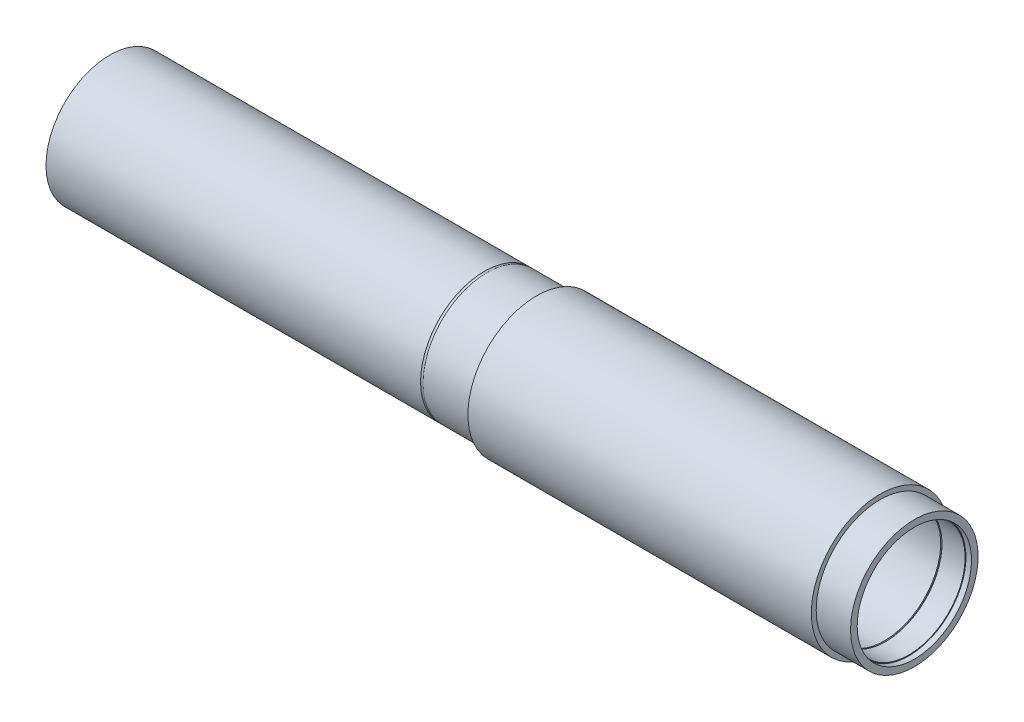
ISO-10303-21;
HEADER;
FILE_DESCRIPTION(('STEP AP214'),'2;1');
FILE_NAME('part.step','',(''),(''),'','','');
FILE_SCHEMA(('AUTOMOTIVE_DESIGN { 1 0 10303 214 1 1 1 1 }'));
ENDSEC;
DATA;
#1=APPLICATION_CONTEXT('core data for automotive mechanical design processes');
#2=APPLICATION_PROTOCOL_DEFINITION('international standard','automotive_design',2000,#1);
#3=PRODUCT_CONTEXT('',#1,'mechanical');
#4=PRODUCT('Part','Part','',(#3));
#5=PRODUCT_RELATED_PRODUCT_CATEGORY('part','',(#4));
#6=PRODUCT_DEFINITION_FORMATION('','',#4);
#7=PRODUCT_DEFINITION_CONTEXT('part definition',#1,'design');
#8=PRODUCT_DEFINITION('design','',#6,#7);
#9=PRODUCT_DEFINITION_SHAPE('','',#8);
#10=(LENGTH_UNIT() NAMED_UNIT(*) SI_UNIT(.MILLI.,.METRE.));
#11=(NAMED_UNIT(*) PLANE_ANGLE_UNIT() SI_UNIT($,.RADIAN.));
#12=(NAMED_UNIT(*) SI_UNIT($,.STERADIAN.) SOLID_ANGLE_UNIT());
#13=UNCERTAINTY_MEASURE_WITH_UNIT(LENGTH_MEASURE(1.E-05),#10,'distance_accuracy_value','');
#14=(GEOMETRIC_REPRESENTATION_CONTEXT(3) GLOBAL_UNCERTAINTY_ASSIGNED_CONTEXT((#13)) GLOBAL_UNIT_ASSIGNED_CONTEXT((#10,
#11,#12)) REPRESENTATION_CONTEXT('',''));
#15=CARTESIAN_POINT('',(0.,0.,0.));
#16=DIRECTION('',(0.,0.,1.));
#17=DIRECTION('',(1.,0.,0.));
#18=AXIS2_PLACEMENT_3D('',#15,#16,#17);
#19=CARTESIAN_POINT('',(552.449999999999,0.,0.));
#20=DIRECTION('',(1.,0.,0.));
#21=DIRECTION('',(0.,0.,-1.));
#22=AXIS2_PLACEMENT_3D('',#19,#20,#21);
#23=CYLINDRICAL_SURFACE('',#22,88.9);
#24=CARTESIAN_POINT('',(552.449999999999,0.,0.));
#25=DIRECTION('',(1.,0.,0.));
#26=DIRECTION('',(0.,0.,-1.));
#27=AXIS2_PLACEMENT_3D('',#24,#25,#26);
#28=CIRCLE('',#27,88.9);
#29=CARTESIAN_POINT('',(552.449999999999,0.,-88.9));
#30=VERTEX_POINT('',#29);
#31=EDGE_CURVE('E11',#30,#30,#28,.T.);
#32=ORIENTED_EDGE('',*,*,#31,.T.);
#33=EDGE_LOOP('',(#32));
#34=FACE_BOUND('',#33,.T.);
#35=CARTESIAN_POINT('',(996.949999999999,0.,0.));
#36=DIRECTION('',(1.,0.,0.));
#37=DIRECTION('',(0.,0.,-1.));
#38=AXIS2_PLACEMENT_3D('',#35,#36,#37);
#39=CIRCLE('',#38,88.9);
#40=CARTESIAN_POINT('',(996.949999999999,0.,-88.9));
#41=VERTEX_POINT('',#40);
#42=EDGE_CURVE('E47',#41,#41,#39,.T.);
#43=ORIENTED_EDGE('',*,*,#42,.F.);
#44=EDGE_LOOP('',(#43));
#45=FACE_BOUND('',#44,.T.);
#46=ADVANCED_FACE('F41',(#34,#45),#23,.T.);
#47=CARTESIAN_POINT('',(552.449999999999,0.,0.));
#48=DIRECTION('',(1.,0.,0.));
#49=DIRECTION('',(0.,0.,-1.));
#50=AXIS2_PLACEMENT_3D('',#47,#48,#49);
#51=PLANE('',#50);
#52=CARTESIAN_POINT('',(552.449999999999,0.,0.));
#53=DIRECTION('',(1.,0.,0.));
#54=DIRECTION('',(0.,0.,-1.));
#55=AXIS2_PLACEMENT_3D('',#52,#53,#54);
#56=CIRCLE('',#55,82.5627);
#57=CARTESIAN_POINT('',(552.449999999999,0.,-82.5627));
#58=VERTEX_POINT('',#57);
#59=EDGE_CURVE('E51',#58,#58,#56,.T.);
#60=ORIENTED_EDGE('',*,*,#59,.T.);
#61=EDGE_LOOP('',(#60));
#62=FACE_BOUND('',#61,.T.);
#63=ORIENTED_EDGE('',*,*,#31,.F.);
#64=EDGE_LOOP('',(#63));
#65=FACE_BOUND('',#64,.T.);
#66=ADVANCED_FACE('F65',(#62,#65),#51,.F.);
#67=CARTESIAN_POINT('',(996.949999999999,0.,0.));
#68=DIRECTION('',(1.,0.,0.));
#69=DIRECTION('',(0.,0.,-1.));
#70=AXIS2_PLACEMENT_3D('',#67,#68,#69);
#71=PLANE('',#70);
#72=CARTESIAN_POINT('',(996.949999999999,0.,0.));
#73=DIRECTION('',(1.,0.,0.));
#74=DIRECTION('',(0.,0.,-1.));
#75=AXIS2_PLACEMENT_3D('',#72,#73,#74);
#76=CIRCLE('',#75,82.5627);
#77=CARTESIAN_POINT('',(996.949999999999,0.,-82.5627));
#78=VERTEX_POINT('',#77);
#79=EDGE_CURVE('E55',#78,#78,#76,.T.);
#80=ORIENTED_EDGE('',*,*,#79,.F.);
#81=EDGE_LOOP('',(#80));
#82=FACE_BOUND('',#81,.T.);
#83=ORIENTED_EDGE('',*,*,#42,.T.);
#84=EDGE_LOOP('',(#83));
#85=FACE_BOUND('',#84,.T.);
#86=ADVANCED_FACE('F63',(#82,#85),#71,.T.);
#87=CARTESIAN_POINT('',(552.449999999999,0.,0.));
#88=DIRECTION('',(1.,0.,0.));
#89=DIRECTION('',(0.,0.,-1.));
#90=AXIS2_PLACEMENT_3D('',#87,#88,#89);
#91=CYLINDRICAL_SURFACE('',#90,82.5627);
#92=ORIENTED_EDGE('',*,*,#59,.F.);
#93=EDGE_LOOP('',(#92));
#94=FACE_BOUND('',#93,.T.);
#95=ORIENTED_EDGE('',*,*,#79,.T.);
#96=EDGE_LOOP('',(#95));
#97=FACE_BOUND('',#96,.T.);
#98=ADVANCED_FACE('F61',(#94,#97),#91,.F.);
#99=CLOSED_SHELL('',(#46,#66,#86,#98));
#100=MANIFOLD_SOLID_BREP('B2',#99);
#101=CARTESIAN_POINT('',(0.,0.,0.));
#102=DIRECTION('',(-1.,0.,0.));
#103=DIRECTION('',(0.,0.,1.));
#104=AXIS2_PLACEMENT_3D('',#101,#102,#103);
#105=CYLINDRICAL_SURFACE('',#104,82.5626999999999);
#106=CARTESIAN_POINT('',(964.819,0.,0.));
#107=DIRECTION('',(-1.,0.,0.));
#108=DIRECTION('',(0.,0.,1.));
#109=AXIS2_PLACEMENT_3D('',#106,#107,#108);
#110=CIRCLE('',#109,82.5627);
#111=CARTESIAN_POINT('',(964.819,0.,82.5627));
#112=VERTEX_POINT('',#111);
#113=EDGE_CURVE('E499',#112,#112,#110,.T.);
#114=ORIENTED_EDGE('',*,*,#113,.T.);
#115=EDGE_LOOP('',(#114));
#116=FACE_BOUND('',#115,.T.);
#117=CARTESIAN_POINT('',(587.121,0.,0.));
#118=DIRECTION('',(-1.,0.,0.));
#119=DIRECTION('',(0.,0.,1.));
#120=AXIS2_PLACEMENT_3D('',#117,#118,#119);
#121=CIRCLE('',#120,82.5626999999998);
#122=CARTESIAN_POINT('',(587.121,0.,82.5626999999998));
#123=VERTEX_POINT('',#122);
#124=EDGE_CURVE('E496',#123,#123,#121,.T.);
#125=ORIENTED_EDGE('',*,*,#124,.F.);
#126=EDGE_LOOP('',(#125));
#127=FACE_BOUND('',#126,.T.);
#128=CARTESIAN_POINT('',(716.8515,0.,82.5626999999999));
#129=CARTESIAN_POINT('',(716.851501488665,0.172794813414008,82.5627003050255));
#130=CARTESIAN_POINT('',(716.844225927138,0.345566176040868,82.5621564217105));
#131=CARTESIAN_POINT('',(716.815176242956,0.689934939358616,82.5599967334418));
#132=CARTESIAN_POINT('',(716.793398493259,0.861532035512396,82.5583806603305));
#133=CARTESIAN_POINT('',(716.73547215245,1.20241515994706,82.5541199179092));
#134=CARTESIAN_POINT('',(716.699311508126,1.37169912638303,82.5514743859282));
#135=CARTESIAN_POINT('',(716.612865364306,1.70667016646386,82.5452286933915));
#136=CARTESIAN_POINT('',(716.562574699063,1.87235590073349,82.5416281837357));
#137=CARTESIAN_POINT('',(716.448288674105,2.19873843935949,82.5335786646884));
#138=CARTESIAN_POINT('',(716.384305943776,2.35943968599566,82.5291304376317));
#139=CARTESIAN_POINT('',(716.243040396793,2.67493456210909,82.5195072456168));
#140=CARTESIAN_POINT('',(716.165752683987,2.82972599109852,82.5143320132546));
#141=CARTESIAN_POINT('',(715.998494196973,3.13215611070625,82.5034054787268));
#142=CARTESIAN_POINT('',(715.908530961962,3.27979898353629,82.4976545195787));
#143=CARTESIAN_POINT('',(715.716489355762,3.56704436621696,82.4857339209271));
#144=CARTESIAN_POINT('',(715.614406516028,3.7066438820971,82.479564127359));
#145=CARTESIAN_POINT('',(715.398715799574,3.97695973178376,82.4669725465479));
#146=CARTESIAN_POINT('',(715.285091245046,4.10766274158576,82.4605504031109));
#147=CARTESIAN_POINT('',(715.047201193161,4.35908536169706,82.4476419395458));
#148=CARTESIAN_POINT('',(714.922931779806,4.47980126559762,82.4411555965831));
#149=CARTESIAN_POINT('',(714.664707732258,4.71030535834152,82.4283069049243));
#150=CARTESIAN_POINT('',(714.530756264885,4.82009709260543,82.4219445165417));
#151=CARTESIAN_POINT('',(714.254026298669,5.0280590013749,82.4095195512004));
#152=CARTESIAN_POINT('',(714.111244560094,5.12622487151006,82.4034570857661));
#153=CARTESIAN_POINT('',(713.817789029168,5.31026382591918,82.391802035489));
#154=CARTESIAN_POINT('',(713.667109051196,5.39612707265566,82.3862098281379));
#155=CARTESIAN_POINT('',(713.358976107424,5.55488366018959,82.3756579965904));
#156=CARTESIAN_POINT('',(713.20152065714,5.62777219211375,82.3706986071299));
#157=CARTESIAN_POINT('',(712.881052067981,5.75999209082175,82.3615585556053));
#158=CARTESIAN_POINT('',(712.718041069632,5.81932861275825,82.35737759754));
#159=CARTESIAN_POINT('',(712.387565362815,5.92406981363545,82.3499091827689));
#160=CARTESIAN_POINT('',(712.220099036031,5.9694693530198,82.346622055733));
#161=CARTESIAN_POINT('',(711.713553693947,6.08401626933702,82.3382679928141));
#162=CARTESIAN_POINT('',(711.36936956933,6.13190637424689,82.3346801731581));
#163=CARTESIAN_POINT('',(710.678017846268,6.16921870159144,82.3318921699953));
#164=CARTESIAN_POINT('',(710.330850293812,6.15864182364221,82.3326919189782));
#165=CARTESIAN_POINT('',(709.643891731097,6.07948522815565,82.3385744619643));
#166=CARTESIAN_POINT('',(709.304087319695,6.01102191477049,82.3436486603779));
#167=CARTESIAN_POINT('',(708.640820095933,5.81819628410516,82.3574968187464));
#168=CARTESIAN_POINT('',(708.317357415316,5.69383351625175,82.366270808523));
#169=CARTESIAN_POINT('',(707.695566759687,5.39261341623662,82.3865392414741));
#170=CARTESIAN_POINT('',(707.39726430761,5.21570358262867,82.3980364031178));
#171=CARTESIAN_POINT('',(706.834545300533,4.81444764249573,82.4224531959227));
#172=CARTESIAN_POINT('',(706.57012929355,4.59010076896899,82.4353728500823));
#173=CARTESIAN_POINT('',(706.08201059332,4.0996852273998,82.4612169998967));
#174=CARTESIAN_POINT('',(705.858409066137,3.83351585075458,82.4741414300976));
#175=CARTESIAN_POINT('',(705.459048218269,3.26736288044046,82.4985085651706));
#176=CARTESIAN_POINT('',(705.283288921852,2.96737926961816,82.509951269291));
#177=CARTESIAN_POINT('',(704.984608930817,2.34204951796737,82.530067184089));
#178=CARTESIAN_POINT('',(704.861692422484,2.01670137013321,82.5387401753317));
#179=CARTESIAN_POINT('',(704.672256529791,1.34990688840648,82.5523367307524));
#180=CARTESIAN_POINT('',(704.605736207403,1.00846082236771,82.5572603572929));
#181=CARTESIAN_POINT('',(704.531107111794,0.320040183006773,82.5627953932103));
#182=CARTESIAN_POINT('',(704.52285853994,-0.0269191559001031,82.5634171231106));
#183=CARTESIAN_POINT('',(704.564641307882,-0.717288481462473,82.5603058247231));
#184=CARTESIAN_POINT('',(704.614672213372,-1.06069849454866,82.5565728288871));
#185=CARTESIAN_POINT('',(704.771477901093,-1.73382459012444,82.5451787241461));
#186=CARTESIAN_POINT('',(704.878188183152,-2.06355577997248,82.5375220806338));
#187=CARTESIAN_POINT('',(705.145257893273,-2.70043157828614,82.5191413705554));
#188=CARTESIAN_POINT('',(705.305618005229,-3.00757589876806,82.5084172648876));
#189=CARTESIAN_POINT('',(705.675788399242,-3.59119731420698,82.4850793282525));
#190=CARTESIAN_POINT('',(705.885691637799,-3.86761530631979,82.4724619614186));
#191=CARTESIAN_POINT('',(706.348856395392,-4.38134157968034,82.4467680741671));
#192=CARTESIAN_POINT('',(706.602118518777,-4.61864931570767,82.4336915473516));
#193=CARTESIAN_POINT('',(707.145412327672,-5.04789610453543,82.4085227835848));
#194=CARTESIAN_POINT('',(707.4355159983,-5.23974417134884,82.3964325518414));
#195=CARTESIAN_POINT('',(708.043915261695,-5.5720007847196,82.3746325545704));
#196=CARTESIAN_POINT('',(708.362210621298,-5.71240975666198,82.3649227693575));
#197=CARTESIAN_POINT('',(709.01756692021,-5.93765305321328,82.3489921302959));
#198=CARTESIAN_POINT('',(709.35460843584,-6.02254378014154,82.3427677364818));
#199=CARTESIAN_POINT('',(710.038397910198,-6.1344996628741,82.3345045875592));
#200=CARTESIAN_POINT('',(710.385145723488,-6.16156568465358,82.332465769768));
#201=CARTESIAN_POINT('',(710.904213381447,-6.15828012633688,82.3327081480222));
#202=CARTESIAN_POINT('',(711.076942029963,-6.14989162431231,82.3333374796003));
#203=CARTESIAN_POINT('',(711.4210597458,-6.11863563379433,82.3356667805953));
#204=CARTESIAN_POINT('',(711.592449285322,-6.0957735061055,82.3373663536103));
#205=CARTESIAN_POINT('',(711.932737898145,-6.03571768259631,82.3417903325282));
#206=CARTESIAN_POINT('',(712.101636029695,-5.99851870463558,82.3445151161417));
#207=CARTESIAN_POINT('',(712.435632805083,-5.91007721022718,82.3509100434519));
#208=CARTESIAN_POINT('',(712.600732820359,-5.85883985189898,82.354579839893));
#209=CARTESIAN_POINT('',(712.926078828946,-5.74266318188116,82.3627624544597));
#210=CARTESIAN_POINT('',(713.086323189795,-5.67771931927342,82.3672755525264));
#211=CARTESIAN_POINT('',(713.40071186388,-5.53463075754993,82.3770139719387));
#212=CARTESIAN_POINT('',(713.554858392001,-5.45649090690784,82.3822390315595));
#213=CARTESIAN_POINT('',(713.856079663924,-5.28752038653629,82.3932565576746));
#214=CARTESIAN_POINT('',(714.003151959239,-5.19668536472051,82.3990492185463));
#215=CARTESIAN_POINT('',(714.289081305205,-5.00302414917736,82.4110343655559));
#216=CARTESIAN_POINT('',(714.427941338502,-4.90020234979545,82.4172267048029));
#217=CARTESIAN_POINT('',(714.696891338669,-4.68297409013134,82.4298553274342));
#218=CARTESIAN_POINT('',(714.826956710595,-4.56853721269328,82.4362922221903));
#219=CARTESIAN_POINT('',(715.076942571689,-4.32916345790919,82.4492094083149));
#220=CARTESIAN_POINT('',(715.196866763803,-4.20423044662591,82.4556896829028));
#221=CARTESIAN_POINT('',(715.425847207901,-3.94462991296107,82.4685165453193));
#222=CARTESIAN_POINT('',(715.534896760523,-3.80995647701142,82.4748630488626));
#223=CARTESIAN_POINT('',(715.741233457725,-3.53194523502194,82.4872362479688));
#224=CARTESIAN_POINT('',(715.838524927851,-3.38861064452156,82.4932630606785));
#225=CARTESIAN_POINT('',(716.02087880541,-3.09395657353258,82.5048401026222));
#226=CARTESIAN_POINT('',(716.105917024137,-2.942622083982,82.5103893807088));
#227=CARTESIAN_POINT('',(716.262900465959,-2.63335726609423,82.5208385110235));
#228=CARTESIAN_POINT('',(716.334850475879,-2.4754293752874,82.5257386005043));
#229=CARTESIAN_POINT('',(716.465123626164,-2.15418144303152,82.5347485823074));
#230=CARTESIAN_POINT('',(716.523458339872,-1.99086611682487,82.5388591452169));
#231=CARTESIAN_POINT('',(716.626144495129,-1.65993529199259,82.5461776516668));
#232=CARTESIAN_POINT('',(716.67049947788,-1.49232089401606,82.5493858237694));
#233=CARTESIAN_POINT('',(716.755445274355,-1.10608496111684,82.5555755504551));
#234=CARTESIAN_POINT('',(716.791433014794,-0.88643042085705,82.5582370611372));
#235=CARTESIAN_POINT('',(716.839459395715,-0.444504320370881,82.5617990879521));
#236=CARTESIAN_POINT('',(716.851498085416,-0.222232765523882,82.5626996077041));
#237=CARTESIAN_POINT('',(716.8515,0.,82.5626999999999));
#238=B_SPLINE_CURVE_WITH_KNOTS('',3,(#128,#129,#130,#131,#132,#133,#134,#135,#136,#137,#138,
#139,#140,#141,#142,#143,#144,#145,#146,#147,#148,#149,#150,#151,#152,#153,#154,#155,#156,#157,
#158,#159,#160,#161,#162,#163,#164,#165,#166,#167,#168,#169,#170,#171,#172,#173,#174,#175,#176,
#177,#178,#179,#180,#181,#182,#183,#184,#185,#186,#187,#188,#189,#190,#191,#192,#193,#194,#195,
#196,#197,#198,#199,#200,#201,#202,#203,#204,#205,#206,#207,#208,#209,#210,#211,#212,#213,#214,
#215,#216,#217,#218,#219,#220,#221,#222,#223,#224,#225,#226,#227,#228,#229,#230,#231,#232,#233,
#234,#235,#236,#237),.UNSPECIFIED.,.T.,.F.,(4,2,2,2,2,2,2,2,2,2,2,2,2,2,2,2,2,2,2,2,2,2,2,2,2,2,
2,2,2,2,2,2,2,2,2,2,2,2,2,2,2,2,2,2,2,2,2,2,2,2,2,2,2,2,4),(0.,0.518190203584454,
1.03651005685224,1.55526519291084,2.07421022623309,2.59267863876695,3.11133825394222,
3.62969067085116,4.14823480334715,4.66753919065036,5.18703544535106,5.70636254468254,
6.22588132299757,6.74581323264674,7.26593744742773,7.78586347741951,8.30598101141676,
9.34314419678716,10.3802914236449,11.4153579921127,12.4504329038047,13.4865454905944,
14.5226748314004,15.5613385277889,16.6000027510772,17.6387492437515,18.677478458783,
19.7137148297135,20.7499434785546,21.7849954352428,22.8200605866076,23.8570834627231,
24.8941207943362,25.9332165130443,26.9723036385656,28.0103334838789,29.048347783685,
29.5666437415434,30.0847478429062,30.6030430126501,31.1211480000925,31.6394252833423,
32.1575125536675,32.675777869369,33.1938537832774,33.7133232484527,34.2326022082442,
34.7521991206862,35.2716042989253,35.7920211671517,36.3122473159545,36.8320296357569,
37.3516801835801,38.018130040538,38.6845785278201),.UNSPECIFIED.);
#239=CARTESIAN_POINT('',(716.8515,0.,82.5626999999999));
#240=VERTEX_POINT('',#239);
#241=EDGE_CURVE('E40',#240,#240,#238,.T.);
#242=ORIENTED_EDGE('',*,*,#241,.F.);
#243=EDGE_LOOP('',(#242));
#244=FACE_BOUND('',#243,.T.);
#245=ADVANCED_FACE('F102',(#116,#127,#244),#105,.T.);
#246=CARTESIAN_POINT('',(0.,0.,0.));
#247=DIRECTION('',(-1.,0.,0.));
#248=DIRECTION('',(0.,0.,1.));
#249=AXIS2_PLACEMENT_3D('',#246,#247,#248);
#250=CYLINDRICAL_SURFACE('',#249,73.0376999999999);
#251=CARTESIAN_POINT('',(753.0973,0.,0.));
#252=DIRECTION('',(-1.,0.,0.));
#253=DIRECTION('',(0.,0.,1.));
#254=AXIS2_PLACEMENT_3D('',#251,#252,#253);
#255=CIRCLE('',#254,73.0376999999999);
#256=CARTESIAN_POINT('',(753.0973,0.,73.0376999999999));
#257=VERTEX_POINT('',#256);
#258=EDGE_CURVE('E645',#257,#257,#255,.T.);
#259=ORIENTED_EDGE('',*,*,#258,.F.);
#260=EDGE_LOOP('',(#259));
#261=FACE_BOUND('',#260,.T.);
#262=CARTESIAN_POINT('',(288.3154,0.,0.));
#263=DIRECTION('',(-1.,0.,0.));
#264=DIRECTION('',(0.,0.,1.));
#265=AXIS2_PLACEMENT_3D('',#262,#263,#264);
#266=CIRCLE('',#265,73.0376999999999);
#267=CARTESIAN_POINT('',(288.3154,0.,73.0376999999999));
#268=VERTEX_POINT('',#267);
#269=EDGE_CURVE('E648',#268,#268,#266,.T.);
#270=ORIENTED_EDGE('',*,*,#269,.T.);
#271=EDGE_LOOP('',(#270));
#272=FACE_BOUND('',#271,.T.);
#273=CARTESIAN_POINT('',(714.1464,0.,73.0376999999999));
#274=CARTESIAN_POINT('',(714.146391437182,-0.193918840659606,73.0376989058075));
#275=CARTESIAN_POINT('',(714.130016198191,-0.387975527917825,73.0369194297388));
#276=CARTESIAN_POINT('',(714.064923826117,-0.770736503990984,73.0338848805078));
#277=CARTESIAN_POINT('',(714.01616850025,-0.959434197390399,73.031628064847));
#278=CARTESIAN_POINT('',(713.887714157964,-1.32587707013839,73.0258942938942));
#279=CARTESIAN_POINT('',(713.808030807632,-1.50362774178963,73.0224179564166));
#280=CARTESIAN_POINT('',(713.620006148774,-1.84318188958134,73.014636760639));
#281=CARTESIAN_POINT('',(713.511671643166,-2.00498913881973,73.0103320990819));
#282=CARTESIAN_POINT('',(713.269308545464,-2.30826048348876,73.0013741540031));
#283=CARTESIAN_POINT('',(713.135259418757,-2.44970816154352,72.996720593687));
#284=CARTESIAN_POINT('',(712.845312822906,-2.70810543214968,72.9875917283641));
#285=CARTESIAN_POINT('',(712.689414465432,-2.82505402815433,72.9831164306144));
#286=CARTESIAN_POINT('',(712.360110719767,-3.03117706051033,72.9748468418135));
#287=CARTESIAN_POINT('',(712.186697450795,-3.12033891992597,72.9710528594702));
#288=CARTESIAN_POINT('',(711.827341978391,-3.26827673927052,72.9645770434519));
#289=CARTESIAN_POINT('',(711.641399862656,-3.32705291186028,72.9618952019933));
#290=CARTESIAN_POINT('',(711.262413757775,-3.41250820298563,72.9579485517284));
#291=CARTESIAN_POINT('',(711.069375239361,-3.43921153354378,72.9566826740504));
#292=CARTESIAN_POINT('',(710.681551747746,-3.45983782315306,72.9557074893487));
#293=CARTESIAN_POINT('',(710.486766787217,-3.45376101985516,72.9559981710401));
#294=CARTESIAN_POINT('',(710.101144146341,-3.40901973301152,72.9581023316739));
#295=CARTESIAN_POINT('',(709.910303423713,-3.37038140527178,72.9599145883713));
#296=CARTESIAN_POINT('',(709.537819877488,-3.26165439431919,72.9648557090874));
#297=CARTESIAN_POINT('',(709.356177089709,-3.19156558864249,72.9679845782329));
#298=CARTESIAN_POINT('',(709.007161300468,-3.02189728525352,72.9752076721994));
#299=CARTESIAN_POINT('',(708.839794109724,-2.92230585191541,72.9793022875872));
#300=CARTESIAN_POINT('',(708.524144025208,-2.69646803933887,72.9879949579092));
#301=CARTESIAN_POINT('',(708.375861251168,-2.57022149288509,72.9925930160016));
#302=CARTESIAN_POINT('',(708.102436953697,-2.29450947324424,73.0017797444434));
#303=CARTESIAN_POINT('',(707.977318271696,-2.14502134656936,73.0063684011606));
#304=CARTESIAN_POINT('',(707.753949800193,-1.82714924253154,73.015014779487));
#305=CARTESIAN_POINT('',(707.655700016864,-1.65876526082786,73.0190725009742));
#306=CARTESIAN_POINT('',(707.488860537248,-1.30786798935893,73.0261998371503));
#307=CARTESIAN_POINT('',(707.420271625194,-1.12535432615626,73.0292694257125));
#308=CARTESIAN_POINT('',(707.314715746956,-0.751384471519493,73.0340741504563));
#309=CARTESIAN_POINT('',(707.277748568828,-0.55992834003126,73.035809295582));
#310=CARTESIAN_POINT('',(707.236513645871,-0.173706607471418,73.0377484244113));
#311=CARTESIAN_POINT('',(707.232214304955,0.021055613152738,73.0379538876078));
#312=CARTESIAN_POINT('',(707.25635466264,0.408535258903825,73.0368144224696));
#313=CARTESIAN_POINT('',(707.284794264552,0.601252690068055,73.0354694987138));
#314=CARTESIAN_POINT('',(707.373579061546,0.979083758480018,73.0313817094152));
#315=CARTESIAN_POINT('',(707.433909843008,1.16420079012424,73.0286394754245));
#316=CARTESIAN_POINT('',(707.584749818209,1.52168078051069,73.0220658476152));
#317=CARTESIAN_POINT('',(707.675259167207,1.69404367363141,73.0182344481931));
#318=CARTESIAN_POINT('',(707.883968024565,2.0212677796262,73.0099099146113));
#319=CARTESIAN_POINT('',(708.002188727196,2.17611546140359,73.0054162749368));
#320=CARTESIAN_POINT('',(708.262933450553,2.46377756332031,72.9962750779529));
#321=CARTESIAN_POINT('',(708.405457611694,2.5965918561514,72.9916275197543));
#322=CARTESIAN_POINT('',(708.710899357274,2.83652331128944,72.9826981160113));
#323=CARTESIAN_POINT('',(708.873833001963,2.94362004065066,72.9784165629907));
#324=CARTESIAN_POINT('',(709.215387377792,3.1289366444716,72.9707065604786));
#325=CARTESIAN_POINT('',(709.394008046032,3.20715663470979,72.9672781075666));
#326=CARTESIAN_POINT('',(709.761790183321,3.33246371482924,72.9616629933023));
#327=CARTESIAN_POINT('',(709.950947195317,3.37956386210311,72.9594758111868));
#328=CARTESIAN_POINT('',(710.334495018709,3.44133697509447,72.9565884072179));
#329=CARTESIAN_POINT('',(710.528885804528,3.45601009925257,72.955888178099));
#330=CARTESIAN_POINT('',(710.917179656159,3.45251111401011,72.9560538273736));
#331=CARTESIAN_POINT('',(711.111083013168,3.43437115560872,72.9569181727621));
#332=CARTESIAN_POINT('',(711.49308817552,3.3658273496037,72.9601123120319));
#333=CARTESIAN_POINT('',(711.68118996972,3.31542344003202,72.9624421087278));
#334=CARTESIAN_POINT('',(712.046259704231,3.18378890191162,72.9683042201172));
#335=CARTESIAN_POINT('',(712.223227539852,3.10255798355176,72.9718365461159));
#336=CARTESIAN_POINT('',(712.561014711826,2.91158119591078,72.9797054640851));
#337=CARTESIAN_POINT('',(712.721834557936,2.80183622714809,72.9840420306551));
#338=CARTESIAN_POINT('',(713.022920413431,2.55683278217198,72.9930354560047));
#339=CARTESIAN_POINT('',(713.163168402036,2.42155217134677,72.9976925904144));
#340=CARTESIAN_POINT('',(713.419006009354,2.12932688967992,73.006800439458));
#341=CARTESIAN_POINT('',(713.534589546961,1.97237689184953,73.0112511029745));
#342=CARTESIAN_POINT('',(713.73786558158,1.64115513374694,73.0194472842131));
#343=CARTESIAN_POINT('',(713.825532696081,1.46686779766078,73.023192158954));
#344=CARTESIAN_POINT('',(713.970256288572,1.10616146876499,73.0295449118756));
#345=CARTESIAN_POINT('',(714.027348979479,0.919757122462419,73.0321541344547));
#346=CARTESIAN_POINT('',(714.094302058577,0.610159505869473,73.0352502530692));
#347=CARTESIAN_POINT('',(714.113813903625,0.48897227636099,73.0361648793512));
#348=CARTESIAN_POINT('',(714.139865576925,0.245208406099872,73.0373900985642));
#349=CARTESIAN_POINT('',(714.146405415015,0.122631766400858,73.0377006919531));
#350=CARTESIAN_POINT('',(714.1464,0.,73.0376999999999));
#351=B_SPLINE_CURVE_WITH_KNOTS('',3,(#273,#274,#275,#276,#277,#278,#279,#280,#281,#282,#283,
#284,#285,#286,#287,#288,#289,#290,#291,#292,#293,#294,#295,#296,#297,#298,#299,#300,#301,#302,
#303,#304,#305,#306,#307,#308,#309,#310,#311,#312,#313,#314,#315,#316,#317,#318,#319,#320,#321,
#322,#323,#324,#325,#326,#327,#328,#329,#330,#331,#332,#333,#334,#335,#336,#337,#338,#339,#340,
#341,#342,#343,#344,#345,#346,#347,#348,#349,#350),.UNSPECIFIED.,.T.,.F.,(4,2,2,2,2,2,2,2,2,2,2,
2,2,2,2,2,2,2,2,2,2,2,2,2,2,2,2,2,2,2,2,2,2,2,2,2,2,2,4),(0.,0.581308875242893,1.16330463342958,
1.74500597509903,2.32656932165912,2.90859902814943,3.49065240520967,4.07296885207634,
4.65528122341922,5.23715372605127,5.81902201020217,6.40042334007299,6.98182693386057,
7.56346606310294,8.14510884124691,8.72732214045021,9.30953557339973,9.89176439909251,
10.4739893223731,11.0556510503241,11.6373110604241,12.2187084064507,12.8001087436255,
13.381955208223,13.9638050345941,14.5461156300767,15.1284238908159,15.7104876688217,
16.2925486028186,16.8740395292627,17.4555315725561,18.0370290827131,18.6185082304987,
19.2004937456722,19.7826225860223,20.3652792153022,20.9472442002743,21.3148566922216,
21.6824689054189),.UNSPECIFIED.);
#352=CARTESIAN_POINT('',(714.1464,0.,73.0376999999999));
#353=VERTEX_POINT('',#352);
#354=EDGE_CURVE('E113',#353,#353,#351,.T.);
#355=ORIENTED_EDGE('',*,*,#354,.F.);
#356=EDGE_LOOP('',(#355));
#357=FACE_BOUND('',#356,.T.);
#358=ADVANCED_FACE('F128',(#261,#272,#357),#250,.F.);
#359=CARTESIAN_POINT('',(7.11200000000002,0.,0.));
#360=DIRECTION('',(-1.,0.,0.));
#361=DIRECTION('',(0.,0.,1.));
#362=AXIS2_PLACEMENT_3D('',#359,#360,#361);
#363=TOROIDAL_SURFACE('',#362,73.7235,0.254000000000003);
#364=CARTESIAN_POINT('',(7.36600000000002,0.,0.));
#365=DIRECTION('',(-1.,0.,0.));
#366=DIRECTION('',(0.,0.,1.));
#367=AXIS2_PLACEMENT_3D('',#364,#365,#366);
#368=CIRCLE('',#367,73.7235);
#369=CARTESIAN_POINT('',(7.36600000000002,0.,73.7235));
#370=VERTEX_POINT('',#369);
#371=EDGE_CURVE('E678',#370,#370,#368,.T.);
#372=ORIENTED_EDGE('',*,*,#371,.F.);
#373=EDGE_LOOP('',(#372));
#374=FACE_BOUND('',#373,.T.);
#375=CARTESIAN_POINT('',(7.11200000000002,0.,0.));
#376=DIRECTION('',(-1.,0.,0.));
#377=DIRECTION('',(0.,0.,1.));
#378=AXIS2_PLACEMENT_3D('',#375,#376,#377);
#379=CIRCLE('',#378,73.9775);
#380=CARTESIAN_POINT('',(7.11200000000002,0.,73.9775));
#381=VERTEX_POINT('',#380);
#382=EDGE_CURVE('E117',#381,#381,#379,.T.);
#383=ORIENTED_EDGE('',*,*,#382,.T.);
#384=EDGE_LOOP('',(#383));
#385=FACE_BOUND('',#384,.T.);
#386=ADVANCED_FACE('F104',(#374,#385),#363,.F.);
#387=CARTESIAN_POINT('',(0.,0.,0.));
#388=DIRECTION('',(-1.,0.,0.));
#389=DIRECTION('',(0.,0.,1.));
#390=AXIS2_PLACEMENT_3D('',#387,#388,#389);
#391=CYLINDRICAL_SURFACE('',#390,73.9775);
#392=ORIENTED_EDGE('',*,*,#382,.F.);
#393=EDGE_LOOP('',(#392));
#394=FACE_BOUND('',#393,.T.);
#395=CARTESIAN_POINT('',(0.,0.,0.));
#396=DIRECTION('',(-1.,0.,0.));
#397=DIRECTION('',(0.,0.,1.));
#398=AXIS2_PLACEMENT_3D('',#395,#396,#397);
#399=CIRCLE('',#398,73.9775);
#400=CARTESIAN_POINT('',(0.,0.,73.9775));
#401=VERTEX_POINT('',#400);
#402=EDGE_CURVE('E121',#401,#401,#399,.T.);
#403=ORIENTED_EDGE('',*,*,#402,.T.);
#404=EDGE_LOOP('',(#403));
#405=FACE_BOUND('',#404,.T.);
#406=ADVANCED_FACE('F366',(#394,#405),#391,.F.);
#407=CARTESIAN_POINT('',(0.,82.5626999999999,0.));
#408=DIRECTION('',(1.,0.,0.));
#409=DIRECTION('',(0.,0.,-1.));
#410=AXIS2_PLACEMENT_3D('',#407,#408,#409);
#411=PLANE('',#410);
#412=ORIENTED_EDGE('',*,*,#402,.F.);
#413=EDGE_LOOP('',(#412));
#414=FACE_BOUND('',#413,.T.);
#415=CARTESIAN_POINT('',(0.,0.,0.));
#416=DIRECTION('',(-1.,0.,0.));
#417=DIRECTION('',(0.,0.,1.));
#418=AXIS2_PLACEMENT_3D('',#415,#416,#417);
#419=CIRCLE('',#418,82.5626999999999);
#420=CARTESIAN_POINT('',(0.,0.,82.5626999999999));
#421=VERTEX_POINT('',#420);
#422=EDGE_CURVE('E378',#421,#421,#419,.T.);
#423=ORIENTED_EDGE('',*,*,#422,.T.);
#424=EDGE_LOOP('',(#423));
#425=FACE_BOUND('',#424,.T.);
#426=ADVANCED_FACE('F363',(#414,#425),#411,.F.);
#427=CARTESIAN_POINT('',(0.,0.,0.));
#428=DIRECTION('',(-1.,0.,0.));
#429=DIRECTION('',(0.,0.,1.));
#430=AXIS2_PLACEMENT_3D('',#427,#428,#429);
#431=CYLINDRICAL_SURFACE('',#430,82.5626999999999);
#432=ORIENTED_EDGE('',*,*,#422,.F.);
#433=EDGE_LOOP('',(#432));
#434=FACE_BOUND('',#433,.T.);
#435=CARTESIAN_POINT('',(484.819708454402,0.,0.));
#436=DIRECTION('',(-1.,0.,0.));
#437=DIRECTION('',(0.,0.,1.));
#438=AXIS2_PLACEMENT_3D('',#435,#436,#437);
#439=CIRCLE('',#438,82.5626999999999);
#440=CARTESIAN_POINT('',(484.819708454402,0.,82.5626999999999));
#441=VERTEX_POINT('',#440);
#442=EDGE_CURVE('E380',#441,#441,#439,.T.);
#443=ORIENTED_EDGE('',*,*,#442,.T.);
#444=EDGE_LOOP('',(#443));
#445=FACE_BOUND('',#444,.T.);
#446=ADVANCED_FACE('F359',(#434,#445),#431,.T.);
#447=CARTESIAN_POINT('',(486.41,0.,0.));
#448=DIRECTION('',(-1.,0.,0.));
#449=DIRECTION('',(0.,0.,1.));
#450=AXIS2_PLACEMENT_3D('',#447,#448,#449);
#451=TOROIDAL_SURFACE('',#450,83.2992999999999,1.75260000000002);
#452=ORIENTED_EDGE('',*,*,#442,.F.);
#453=EDGE_LOOP('',(#452));
#454=FACE_BOUND('',#453,.T.);
#455=CARTESIAN_POINT('',(488.000291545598,0.,0.));
#456=DIRECTION('',(-1.,0.,0.));
#457=DIRECTION('',(0.,0.,1.));
#458=AXIS2_PLACEMENT_3D('',#455,#456,#457);
#459=CIRCLE('',#458,82.5626999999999);
#460=CARTESIAN_POINT('',(488.000291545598,0.,82.5626999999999));
#461=VERTEX_POINT('',#460);
#462=EDGE_CURVE('E385',#461,#461,#459,.T.);
#463=ORIENTED_EDGE('',*,*,#462,.T.);
#464=EDGE_LOOP('',(#463));
#465=FACE_BOUND('',#464,.T.);
#466=ADVANCED_FACE('F355',(#454,#465),#451,.F.);
#467=CARTESIAN_POINT('',(0.,0.,0.));
#468=DIRECTION('',(-1.,0.,0.));
#469=DIRECTION('',(0.,0.,1.));
#470=AXIS2_PLACEMENT_3D('',#467,#468,#469);
#471=CYLINDRICAL_SURFACE('',#470,82.5626999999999);
#472=ORIENTED_EDGE('',*,*,#462,.F.);
#473=EDGE_LOOP('',(#472));
#474=FACE_BOUND('',#473,.T.);
#475=CARTESIAN_POINT('',(560.959,0.,0.));
#476=DIRECTION('',(-1.,0.,0.));
#477=DIRECTION('',(0.,0.,1.));
#478=AXIS2_PLACEMENT_3D('',#475,#476,#477);
#479=CIRCLE('',#478,82.5626999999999);
#480=CARTESIAN_POINT('',(560.959,0.,82.5626999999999));
#481=VERTEX_POINT('',#480);
#482=EDGE_CURVE('E388',#481,#481,#479,.T.);
#483=ORIENTED_EDGE('',*,*,#482,.T.);
#484=EDGE_LOOP('',(#483));
#485=FACE_BOUND('',#484,.T.);
#486=ADVANCED_FACE('F351',(#474,#485),#471,.T.);
#487=CARTESIAN_POINT('',(560.959,0.,0.));
#488=DIRECTION('',(-1.,0.,0.));
#489=DIRECTION('',(0.,0.,1.));
#490=AXIS2_PLACEMENT_3D('',#487,#488,#489);
#491=TOROIDAL_SURFACE('',#490,82.1817,0.381000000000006);
#492=ORIENTED_EDGE('',*,*,#482,.F.);
#493=EDGE_LOOP('',(#492));
#494=FACE_BOUND('',#493,.T.);
#495=CARTESIAN_POINT('',(561.34,0.,0.));
#496=DIRECTION('',(-1.,0.,0.));
#497=DIRECTION('',(0.,0.,1.));
#498=AXIS2_PLACEMENT_3D('',#495,#496,#497);
#499=CIRCLE('',#498,82.1817);
#500=CARTESIAN_POINT('',(561.34,0.,82.1817));
#501=VERTEX_POINT('',#500);
#502=EDGE_CURVE('E391',#501,#501,#499,.T.);
#503=ORIENTED_EDGE('',*,*,#502,.T.);
#504=EDGE_LOOP('',(#503));
#505=FACE_BOUND('',#504,.T.);
#506=ADVANCED_FACE('F347',(#494,#505),#491,.T.);
#507=CARTESIAN_POINT('',(561.34,82.1817,0.));
#508=DIRECTION('',(-1.,0.,0.));
#509=DIRECTION('',(0.,0.,1.));
#510=AXIS2_PLACEMENT_3D('',#507,#508,#509);
#511=PLANE('',#510);
#512=ORIENTED_EDGE('',*,*,#502,.F.);
#513=EDGE_LOOP('',(#512));
#514=FACE_BOUND('',#513,.T.);
#515=CARTESIAN_POINT('',(561.34,0.,0.));
#516=DIRECTION('',(-1.,0.,0.));
#517=DIRECTION('',(0.,0.,1.));
#518=AXIS2_PLACEMENT_3D('',#515,#516,#517);
#519=CIRCLE('',#518,81.8007);
#520=CARTESIAN_POINT('',(561.34,0.,81.8007));
#521=VERTEX_POINT('',#520);
#522=EDGE_CURVE('E394',#521,#521,#519,.T.);
#523=ORIENTED_EDGE('',*,*,#522,.T.);
#524=EDGE_LOOP('',(#523));
#525=FACE_BOUND('',#524,.T.);
#526=ADVANCED_FACE('F343',(#514,#525),#511,.F.);
#527=CARTESIAN_POINT('',(562.13375,0.,0.));
#528=DIRECTION('',(-1.,0.,0.));
#529=DIRECTION('',(0.,0.,1.));
#530=AXIS2_PLACEMENT_3D('',#527,#528,#529);
#531=CONICAL_SURFACE('',#530,80.4258846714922,1.04719755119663);
#532=ORIENTED_EDGE('',*,*,#522,.F.);
#533=EDGE_LOOP('',(#532));
#534=FACE_BOUND('',#533,.T.);
#535=CARTESIAN_POINT('',(562.13375,0.,0.));
#536=DIRECTION('',(-1.,0.,0.));
#537=DIRECTION('',(0.,0.,1.));
#538=AXIS2_PLACEMENT_3D('',#535,#536,#537);
#539=CIRCLE('',#538,80.4258846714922);
#540=CARTESIAN_POINT('',(562.13375,0.,80.4258846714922));
#541=VERTEX_POINT('',#540);
#542=EDGE_CURVE('E397',#541,#541,#539,.T.);
#543=ORIENTED_EDGE('',*,*,#542,.T.);
#544=EDGE_LOOP('',(#543));
#545=FACE_BOUND('',#544,.T.);
#546=ADVANCED_FACE('F339',(#534,#545),#531,.T.);
#547=CARTESIAN_POINT('',(562.9275,0.,0.));
#548=DIRECTION('',(1.,0.,0.));
#549=DIRECTION('',(0.,0.,-1.));
#550=AXIS2_PLACEMENT_3D('',#547,#548,#549);
#551=CONICAL_SURFACE('',#550,81.8007,1.04719755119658);
#552=ORIENTED_EDGE('',*,*,#542,.F.);
#553=EDGE_LOOP('',(#552));
#554=FACE_BOUND('',#553,.T.);
#555=CARTESIAN_POINT('',(562.9275,0.,0.));
#556=DIRECTION('',(-1.,0.,0.));
#557=DIRECTION('',(0.,0.,1.));
#558=AXIS2_PLACEMENT_3D('',#555,#556,#557);
#559=CIRCLE('',#558,81.8007);
#560=CARTESIAN_POINT('',(562.9275,0.,81.8007));
#561=VERTEX_POINT('',#560);
#562=EDGE_CURVE('E400',#561,#561,#559,.T.);
#563=ORIENTED_EDGE('',*,*,#562,.T.);
#564=EDGE_LOOP('',(#563));
#565=FACE_BOUND('',#564,.T.);
#566=ADVANCED_FACE('F335',(#554,#565),#551,.T.);
#567=CARTESIAN_POINT('',(563.72125,0.,0.));
#568=DIRECTION('',(-1.,0.,0.));
#569=DIRECTION('',(0.,0.,1.));
#570=AXIS2_PLACEMENT_3D('',#567,#568,#569);
#571=CONICAL_SURFACE('',#570,80.4258846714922,1.04719755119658);
#572=ORIENTED_EDGE('',*,*,#562,.F.);
#573=EDGE_LOOP('',(#572));
#574=FACE_BOUND('',#573,.T.);
#575=CARTESIAN_POINT('',(563.72125,0.,0.));
#576=DIRECTION('',(-1.,0.,0.));
#577=DIRECTION('',(0.,0.,1.));
#578=AXIS2_PLACEMENT_3D('',#575,#576,#577);
#579=CIRCLE('',#578,80.4258846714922);
#580=CARTESIAN_POINT('',(563.72125,0.,80.4258846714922));
#581=VERTEX_POINT('',#580);
#582=EDGE_CURVE('E403',#581,#581,#579,.T.);
#583=ORIENTED_EDGE('',*,*,#582,.T.);
#584=EDGE_LOOP('',(#583));
#585=FACE_BOUND('',#584,.T.);
#586=ADVANCED_FACE('F331',(#574,#585),#571,.T.);
#587=CARTESIAN_POINT('',(564.515,0.,0.));
#588=DIRECTION('',(1.,0.,0.));
#589=DIRECTION('',(0.,0.,-1.));
#590=AXIS2_PLACEMENT_3D('',#587,#588,#589);
#591=CONICAL_SURFACE('',#590,81.8007,1.04719755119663);
#592=ORIENTED_EDGE('',*,*,#582,.F.);
#593=EDGE_LOOP('',(#592));
#594=FACE_BOUND('',#593,.T.);
#595=CARTESIAN_POINT('',(564.515,0.,0.));
#596=DIRECTION('',(-1.,0.,0.));
#597=DIRECTION('',(0.,0.,1.));
#598=AXIS2_PLACEMENT_3D('',#595,#596,#597);
#599=CIRCLE('',#598,81.8007);
#600=CARTESIAN_POINT('',(564.515,0.,81.8007));
#601=VERTEX_POINT('',#600);
#602=EDGE_CURVE('E406',#601,#601,#599,.T.);
#603=ORIENTED_EDGE('',*,*,#602,.T.);
#604=EDGE_LOOP('',(#603));
#605=FACE_BOUND('',#604,.T.);
#606=ADVANCED_FACE('F327',(#594,#605),#591,.T.);
#607=CARTESIAN_POINT('',(565.30875,0.,0.));
#608=DIRECTION('',(-1.,0.,0.));
#609=DIRECTION('',(0.,0.,1.));
#610=AXIS2_PLACEMENT_3D('',#607,#608,#609);
#611=CONICAL_SURFACE('',#610,80.4258846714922,1.04719755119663);
#612=ORIENTED_EDGE('',*,*,#602,.F.);
#613=EDGE_LOOP('',(#612));
#614=FACE_BOUND('',#613,.T.);
#615=CARTESIAN_POINT('',(565.30875,0.,0.));
#616=DIRECTION('',(-1.,0.,0.));
#617=DIRECTION('',(0.,0.,1.));
#618=AXIS2_PLACEMENT_3D('',#615,#616,#617);
#619=CIRCLE('',#618,80.4258846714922);
#620=CARTESIAN_POINT('',(565.30875,0.,80.4258846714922));
#621=VERTEX_POINT('',#620);
#622=EDGE_CURVE('E409',#621,#621,#619,.T.);
#623=ORIENTED_EDGE('',*,*,#622,.T.);
#624=EDGE_LOOP('',(#623));
#625=FACE_BOUND('',#624,.T.);
#626=ADVANCED_FACE('F323',(#614,#625),#611,.T.);
#627=CARTESIAN_POINT('',(566.1025,0.,0.));
#628=DIRECTION('',(1.,0.,0.));
#629=DIRECTION('',(0.,0.,-1.));
#630=AXIS2_PLACEMENT_3D('',#627,#628,#629);
#631=CONICAL_SURFACE('',#630,81.8007,1.04719755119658);
#632=ORIENTED_EDGE('',*,*,#622,.F.);
#633=EDGE_LOOP('',(#632));
#634=FACE_BOUND('',#633,.T.);
#635=CARTESIAN_POINT('',(566.1025,0.,0.));
#636=DIRECTION('',(-1.,0.,0.));
#637=DIRECTION('',(0.,0.,1.));
#638=AXIS2_PLACEMENT_3D('',#635,#636,#637);
#639=CIRCLE('',#638,81.8007);
#640=CARTESIAN_POINT('',(566.1025,0.,81.8007));
#641=VERTEX_POINT('',#640);
#642=EDGE_CURVE('E412',#641,#641,#639,.T.);
#643=ORIENTED_EDGE('',*,*,#642,.T.);
#644=EDGE_LOOP('',(#643));
#645=FACE_BOUND('',#644,.T.);
#646=ADVANCED_FACE('F319',(#634,#645),#631,.T.);
#647=CARTESIAN_POINT('',(566.89625,0.,0.));
#648=DIRECTION('',(-1.,0.,0.));
#649=DIRECTION('',(0.,0.,1.));
#650=AXIS2_PLACEMENT_3D('',#647,#648,#649);
#651=CONICAL_SURFACE('',#650,80.4258846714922,1.04719755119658);
#652=ORIENTED_EDGE('',*,*,#642,.F.);
#653=EDGE_LOOP('',(#652));
#654=FACE_BOUND('',#653,.T.);
#655=CARTESIAN_POINT('',(566.89625,0.,0.));
#656=DIRECTION('',(-1.,0.,0.));
#657=DIRECTION('',(0.,0.,1.));
#658=AXIS2_PLACEMENT_3D('',#655,#656,#657);
#659=CIRCLE('',#658,80.4258846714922);
#660=CARTESIAN_POINT('',(566.89625,0.,80.4258846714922));
#661=VERTEX_POINT('',#660);
#662=EDGE_CURVE('E415',#661,#661,#659,.T.);
#663=ORIENTED_EDGE('',*,*,#662,.T.);
#664=EDGE_LOOP('',(#663));
#665=FACE_BOUND('',#664,.T.);
#666=ADVANCED_FACE('F315',(#654,#665),#651,.T.);
#667=CARTESIAN_POINT('',(567.69,0.,0.));
#668=DIRECTION('',(1.,0.,0.));
#669=DIRECTION('',(0.,0.,-1.));
#670=AXIS2_PLACEMENT_3D('',#667,#668,#669);
#671=CONICAL_SURFACE('',#670,81.8007,1.04719755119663);
#672=ORIENTED_EDGE('',*,*,#662,.F.);
#673=EDGE_LOOP('',(#672));
#674=FACE_BOUND('',#673,.T.);
#675=CARTESIAN_POINT('',(567.69,0.,0.));
#676=DIRECTION('',(-1.,0.,0.));
#677=DIRECTION('',(0.,0.,1.));
#678=AXIS2_PLACEMENT_3D('',#675,#676,#677);
#679=CIRCLE('',#678,81.8007);
#680=CARTESIAN_POINT('',(567.69,0.,81.8007));
#681=VERTEX_POINT('',#680);
#682=EDGE_CURVE('E418',#681,#681,#679,.T.);
#683=ORIENTED_EDGE('',*,*,#682,.T.);
#684=EDGE_LOOP('',(#683));
#685=FACE_BOUND('',#684,.T.);
#686=ADVANCED_FACE('F311',(#674,#685),#671,.T.);
#687=CARTESIAN_POINT('',(568.48375,0.,0.));
#688=DIRECTION('',(-1.,0.,0.));
#689=DIRECTION('',(0.,0.,1.));
#690=AXIS2_PLACEMENT_3D('',#687,#688,#689);
#691=CONICAL_SURFACE('',#690,80.4258846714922,1.04719755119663);
#692=ORIENTED_EDGE('',*,*,#682,.F.);
#693=EDGE_LOOP('',(#692));
#694=FACE_BOUND('',#693,.T.);
#695=CARTESIAN_POINT('',(568.48375,0.,0.));
#696=DIRECTION('',(-1.,0.,0.));
#697=DIRECTION('',(0.,0.,1.));
#698=AXIS2_PLACEMENT_3D('',#695,#696,#697);
#699=CIRCLE('',#698,80.4258846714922);
#700=CARTESIAN_POINT('',(568.48375,0.,80.4258846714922));
#701=VERTEX_POINT('',#700);
#702=EDGE_CURVE('E421',#701,#701,#699,.T.);
#703=ORIENTED_EDGE('',*,*,#702,.T.);
#704=EDGE_LOOP('',(#703));
#705=FACE_BOUND('',#704,.T.);
#706=ADVANCED_FACE('F307',(#694,#705),#691,.T.);
#707=CARTESIAN_POINT('',(569.2775,0.,0.));
#708=DIRECTION('',(1.,0.,0.));
#709=DIRECTION('',(0.,0.,-1.));
#710=AXIS2_PLACEMENT_3D('',#707,#708,#709);
#711=CONICAL_SURFACE('',#710,81.8007,1.04719755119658);
#712=ORIENTED_EDGE('',*,*,#702,.F.);
#713=EDGE_LOOP('',(#712));
#714=FACE_BOUND('',#713,.T.);
#715=CARTESIAN_POINT('',(569.2775,0.,0.));
#716=DIRECTION('',(-1.,0.,0.));
#717=DIRECTION('',(0.,0.,1.));
#718=AXIS2_PLACEMENT_3D('',#715,#716,#717);
#719=CIRCLE('',#718,81.8007);
#720=CARTESIAN_POINT('',(569.2775,0.,81.8007));
#721=VERTEX_POINT('',#720);
#722=EDGE_CURVE('E424',#721,#721,#719,.T.);
#723=ORIENTED_EDGE('',*,*,#722,.T.);
#724=EDGE_LOOP('',(#723));
#725=FACE_BOUND('',#724,.T.);
#726=ADVANCED_FACE('F303',(#714,#725),#711,.T.);
#727=CARTESIAN_POINT('',(570.07125,0.,0.));
#728=DIRECTION('',(-1.,0.,0.));
#729=DIRECTION('',(0.,0.,1.));
#730=AXIS2_PLACEMENT_3D('',#727,#728,#729);
#731=CONICAL_SURFACE('',#730,80.4258846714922,1.04719755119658);
#732=ORIENTED_EDGE('',*,*,#722,.F.);
#733=EDGE_LOOP('',(#732));
#734=FACE_BOUND('',#733,.T.);
#735=CARTESIAN_POINT('',(570.07125,0.,0.));
#736=DIRECTION('',(-1.,0.,0.));
#737=DIRECTION('',(0.,0.,1.));
#738=AXIS2_PLACEMENT_3D('',#735,#736,#737);
#739=CIRCLE('',#738,80.4258846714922);
#740=CARTESIAN_POINT('',(570.07125,0.,80.4258846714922));
#741=VERTEX_POINT('',#740);
#742=EDGE_CURVE('E427',#741,#741,#739,.T.);
#743=ORIENTED_EDGE('',*,*,#742,.T.);
#744=EDGE_LOOP('',(#743));
#745=FACE_BOUND('',#744,.T.);
#746=ADVANCED_FACE('F299',(#734,#745),#731,.T.);
#747=CARTESIAN_POINT('',(570.865,0.,0.));
#748=DIRECTION('',(1.,0.,0.));
#749=DIRECTION('',(0.,0.,-1.));
#750=AXIS2_PLACEMENT_3D('',#747,#748,#749);
#751=CONICAL_SURFACE('',#750,81.8007,1.04719755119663);
#752=ORIENTED_EDGE('',*,*,#742,.F.);
#753=EDGE_LOOP('',(#752));
#754=FACE_BOUND('',#753,.T.);
#755=CARTESIAN_POINT('',(570.865,0.,0.));
#756=DIRECTION('',(-1.,0.,0.));
#757=DIRECTION('',(0.,0.,1.));
#758=AXIS2_PLACEMENT_3D('',#755,#756,#757);
#759=CIRCLE('',#758,81.8007);
#760=CARTESIAN_POINT('',(570.865,0.,81.8007));
#761=VERTEX_POINT('',#760);
#762=EDGE_CURVE('E430',#761,#761,#759,.T.);
#763=ORIENTED_EDGE('',*,*,#762,.T.);
#764=EDGE_LOOP('',(#763));
#765=FACE_BOUND('',#764,.T.);
#766=ADVANCED_FACE('F295',(#754,#765),#751,.T.);
#767=CARTESIAN_POINT('',(571.65875,0.,0.));
#768=DIRECTION('',(-1.,0.,0.));
#769=DIRECTION('',(0.,0.,1.));
#770=AXIS2_PLACEMENT_3D('',#767,#768,#769);
#771=CONICAL_SURFACE('',#770,80.4258846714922,1.04719755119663);
#772=ORIENTED_EDGE('',*,*,#762,.F.);
#773=EDGE_LOOP('',(#772));
#774=FACE_BOUND('',#773,.T.);
#775=CARTESIAN_POINT('',(571.65875,0.,0.));
#776=DIRECTION('',(-1.,0.,0.));
#777=DIRECTION('',(0.,0.,1.));
#778=AXIS2_PLACEMENT_3D('',#775,#776,#777);
#779=CIRCLE('',#778,80.4258846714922);
#780=CARTESIAN_POINT('',(571.65875,0.,80.4258846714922));
#781=VERTEX_POINT('',#780);
#782=EDGE_CURVE('E433',#781,#781,#779,.T.);
#783=ORIENTED_EDGE('',*,*,#782,.T.);
#784=EDGE_LOOP('',(#783));
#785=FACE_BOUND('',#784,.T.);
#786=ADVANCED_FACE('F291',(#774,#785),#771,.T.);
#787=CARTESIAN_POINT('',(572.4525,0.,0.));
#788=DIRECTION('',(1.,0.,0.));
#789=DIRECTION('',(0.,0.,-1.));
#790=AXIS2_PLACEMENT_3D('',#787,#788,#789);
#791=CONICAL_SURFACE('',#790,81.8007,1.04719755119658);
#792=ORIENTED_EDGE('',*,*,#782,.F.);
#793=EDGE_LOOP('',(#792));
#794=FACE_BOUND('',#793,.T.);
#795=CARTESIAN_POINT('',(572.4525,0.,0.));
#796=DIRECTION('',(-1.,0.,0.));
#797=DIRECTION('',(0.,0.,1.));
#798=AXIS2_PLACEMENT_3D('',#795,#796,#797);
#799=CIRCLE('',#798,81.8007);
#800=CARTESIAN_POINT('',(572.4525,0.,81.8007));
#801=VERTEX_POINT('',#800);
#802=EDGE_CURVE('E436',#801,#801,#799,.T.);
#803=ORIENTED_EDGE('',*,*,#802,.T.);
#804=EDGE_LOOP('',(#803));
#805=FACE_BOUND('',#804,.T.);
#806=ADVANCED_FACE('F287',(#794,#805),#791,.T.);
#807=CARTESIAN_POINT('',(573.24625,0.,0.));
#808=DIRECTION('',(-1.,0.,0.));
#809=DIRECTION('',(0.,0.,1.));
#810=AXIS2_PLACEMENT_3D('',#807,#808,#809);
#811=CONICAL_SURFACE('',#810,80.4258846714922,1.04719755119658);
#812=ORIENTED_EDGE('',*,*,#802,.F.);
#813=EDGE_LOOP('',(#812));
#814=FACE_BOUND('',#813,.T.);
#815=CARTESIAN_POINT('',(573.24625,0.,0.));
#816=DIRECTION('',(-1.,0.,0.));
#817=DIRECTION('',(0.,0.,1.));
#818=AXIS2_PLACEMENT_3D('',#815,#816,#817);
#819=CIRCLE('',#818,80.4258846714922);
#820=CARTESIAN_POINT('',(573.24625,0.,80.4258846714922));
#821=VERTEX_POINT('',#820);
#822=EDGE_CURVE('E439',#821,#821,#819,.T.);
#823=ORIENTED_EDGE('',*,*,#822,.T.);
#824=EDGE_LOOP('',(#823));
#825=FACE_BOUND('',#824,.T.);
#826=ADVANCED_FACE('F283',(#814,#825),#811,.T.);
#827=CARTESIAN_POINT('',(574.04,0.,0.));
#828=DIRECTION('',(1.,0.,0.));
#829=DIRECTION('',(0.,0.,-1.));
#830=AXIS2_PLACEMENT_3D('',#827,#828,#829);
#831=CONICAL_SURFACE('',#830,81.8007,1.04719755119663);
#832=ORIENTED_EDGE('',*,*,#822,.F.);
#833=EDGE_LOOP('',(#832));
#834=FACE_BOUND('',#833,.T.);
#835=CARTESIAN_POINT('',(574.04,0.,0.));
#836=DIRECTION('',(-1.,0.,0.));
#837=DIRECTION('',(0.,0.,1.));
#838=AXIS2_PLACEMENT_3D('',#835,#836,#837);
#839=CIRCLE('',#838,81.8007);
#840=CARTESIAN_POINT('',(574.04,0.,81.8007));
#841=VERTEX_POINT('',#840);
#842=EDGE_CURVE('E442',#841,#841,#839,.T.);
#843=ORIENTED_EDGE('',*,*,#842,.T.);
#844=EDGE_LOOP('',(#843));
#845=FACE_BOUND('',#844,.T.);
#846=ADVANCED_FACE('F279',(#834,#845),#831,.T.);
#847=CARTESIAN_POINT('',(574.83375,0.,0.));
#848=DIRECTION('',(-1.,0.,0.));
#849=DIRECTION('',(0.,0.,1.));
#850=AXIS2_PLACEMENT_3D('',#847,#848,#849);
#851=CONICAL_SURFACE('',#850,80.4258846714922,1.04719755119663);
#852=ORIENTED_EDGE('',*,*,#842,.F.);
#853=EDGE_LOOP('',(#852));
#854=FACE_BOUND('',#853,.T.);
#855=CARTESIAN_POINT('',(574.83375,0.,0.));
#856=DIRECTION('',(-1.,0.,0.));
#857=DIRECTION('',(0.,0.,1.));
#858=AXIS2_PLACEMENT_3D('',#855,#856,#857);
#859=CIRCLE('',#858,80.4258846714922);
#860=CARTESIAN_POINT('',(574.83375,0.,80.4258846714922));
#861=VERTEX_POINT('',#860);
#862=EDGE_CURVE('E445',#861,#861,#859,.T.);
#863=ORIENTED_EDGE('',*,*,#862,.T.);
#864=EDGE_LOOP('',(#863));
#865=FACE_BOUND('',#864,.T.);
#866=ADVANCED_FACE('F275',(#854,#865),#851,.T.);
#867=CARTESIAN_POINT('',(575.6275,0.,0.));
#868=DIRECTION('',(1.,0.,0.));
#869=DIRECTION('',(0.,0.,-1.));
#870=AXIS2_PLACEMENT_3D('',#867,#868,#869);
#871=CONICAL_SURFACE('',#870,81.8007,1.04719755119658);
#872=ORIENTED_EDGE('',*,*,#862,.F.);
#873=EDGE_LOOP('',(#872));
#874=FACE_BOUND('',#873,.T.);
#875=CARTESIAN_POINT('',(575.6275,0.,0.));
#876=DIRECTION('',(-1.,0.,0.));
#877=DIRECTION('',(0.,0.,1.));
#878=AXIS2_PLACEMENT_3D('',#875,#876,#877);
#879=CIRCLE('',#878,81.8007);
#880=CARTESIAN_POINT('',(575.6275,0.,81.8007));
#881=VERTEX_POINT('',#880);
#882=EDGE_CURVE('E448',#881,#881,#879,.T.);
#883=ORIENTED_EDGE('',*,*,#882,.T.);
#884=EDGE_LOOP('',(#883));
#885=FACE_BOUND('',#884,.T.);
#886=ADVANCED_FACE('F271',(#874,#885),#871,.T.);
#887=CARTESIAN_POINT('',(576.42125,0.,0.));
#888=DIRECTION('',(-1.,0.,0.));
#889=DIRECTION('',(0.,0.,1.));
#890=AXIS2_PLACEMENT_3D('',#887,#888,#889);
#891=CONICAL_SURFACE('',#890,80.4258846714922,1.04719755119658);
#892=ORIENTED_EDGE('',*,*,#882,.F.);
#893=EDGE_LOOP('',(#892));
#894=FACE_BOUND('',#893,.T.);
#895=CARTESIAN_POINT('',(576.42125,0.,0.));
#896=DIRECTION('',(-1.,0.,0.));
#897=DIRECTION('',(0.,0.,1.));
#898=AXIS2_PLACEMENT_3D('',#895,#896,#897);
#899=CIRCLE('',#898,80.4258846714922);
#900=CARTESIAN_POINT('',(576.42125,0.,80.4258846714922));
#901=VERTEX_POINT('',#900);
#902=EDGE_CURVE('E451',#901,#901,#899,.T.);
#903=ORIENTED_EDGE('',*,*,#902,.T.);
#904=EDGE_LOOP('',(#903));
#905=FACE_BOUND('',#904,.T.);
#906=ADVANCED_FACE('F267',(#894,#905),#891,.T.);
#907=CARTESIAN_POINT('',(577.215,0.,0.));
#908=DIRECTION('',(1.,0.,0.));
#909=DIRECTION('',(0.,0.,-1.));
#910=AXIS2_PLACEMENT_3D('',#907,#908,#909);
#911=CONICAL_SURFACE('',#910,81.8007,1.04719755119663);
#912=ORIENTED_EDGE('',*,*,#902,.F.);
#913=EDGE_LOOP('',(#912));
#914=FACE_BOUND('',#913,.T.);
#915=CARTESIAN_POINT('',(577.215,0.,0.));
#916=DIRECTION('',(-1.,0.,0.));
#917=DIRECTION('',(0.,0.,1.));
#918=AXIS2_PLACEMENT_3D('',#915,#916,#917);
#919=CIRCLE('',#918,81.8007);
#920=CARTESIAN_POINT('',(577.215,0.,81.8007));
#921=VERTEX_POINT('',#920);
#922=EDGE_CURVE('E454',#921,#921,#919,.T.);
#923=ORIENTED_EDGE('',*,*,#922,.T.);
#924=EDGE_LOOP('',(#923));
#925=FACE_BOUND('',#924,.T.);
#926=ADVANCED_FACE('F263',(#914,#925),#911,.T.);
#927=CARTESIAN_POINT('',(578.00875,0.,0.));
#928=DIRECTION('',(-1.,0.,0.));
#929=DIRECTION('',(0.,0.,1.));
#930=AXIS2_PLACEMENT_3D('',#927,#928,#929);
#931=CONICAL_SURFACE('',#930,80.4258846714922,1.04719755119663);
#932=ORIENTED_EDGE('',*,*,#922,.F.);
#933=EDGE_LOOP('',(#932));
#934=FACE_BOUND('',#933,.T.);
#935=CARTESIAN_POINT('',(578.00875,0.,0.));
#936=DIRECTION('',(-1.,0.,0.));
#937=DIRECTION('',(0.,0.,1.));
#938=AXIS2_PLACEMENT_3D('',#935,#936,#937);
#939=CIRCLE('',#938,80.4258846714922);
#940=CARTESIAN_POINT('',(578.00875,0.,80.4258846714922));
#941=VERTEX_POINT('',#940);
#942=EDGE_CURVE('E457',#941,#941,#939,.T.);
#943=ORIENTED_EDGE('',*,*,#942,.T.);
#944=EDGE_LOOP('',(#943));
#945=FACE_BOUND('',#944,.T.);
#946=ADVANCED_FACE('F259',(#934,#945),#931,.T.);
#947=CARTESIAN_POINT('',(578.8025,0.,0.));
#948=DIRECTION('',(1.,0.,0.));
#949=DIRECTION('',(0.,0.,-1.));
#950=AXIS2_PLACEMENT_3D('',#947,#948,#949);
#951=CONICAL_SURFACE('',#950,81.8007,1.04719755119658);
#952=ORIENTED_EDGE('',*,*,#942,.F.);
#953=EDGE_LOOP('',(#952));
#954=FACE_BOUND('',#953,.T.);
#955=CARTESIAN_POINT('',(578.8025,0.,0.));
#956=DIRECTION('',(-1.,0.,0.));
#957=DIRECTION('',(0.,0.,1.));
#958=AXIS2_PLACEMENT_3D('',#955,#956,#957);
#959=CIRCLE('',#958,81.8007);
#960=CARTESIAN_POINT('',(578.8025,0.,81.8007));
#961=VERTEX_POINT('',#960);
#962=EDGE_CURVE('E460',#961,#961,#959,.T.);
#963=ORIENTED_EDGE('',*,*,#962,.T.);
#964=EDGE_LOOP('',(#963));
#965=FACE_BOUND('',#964,.T.);
#966=ADVANCED_FACE('F255',(#954,#965),#951,.T.);
#967=CARTESIAN_POINT('',(579.59625,0.,0.));
#968=DIRECTION('',(-1.,0.,0.));
#969=DIRECTION('',(0.,0.,1.));
#970=AXIS2_PLACEMENT_3D('',#967,#968,#969);
#971=CONICAL_SURFACE('',#970,80.4258846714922,1.04719755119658);
#972=ORIENTED_EDGE('',*,*,#962,.F.);
#973=EDGE_LOOP('',(#972));
#974=FACE_BOUND('',#973,.T.);
#975=CARTESIAN_POINT('',(579.59625,0.,0.));
#976=DIRECTION('',(-1.,0.,0.));
#977=DIRECTION('',(0.,0.,1.));
#978=AXIS2_PLACEMENT_3D('',#975,#976,#977);
#979=CIRCLE('',#978,80.4258846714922);
#980=CARTESIAN_POINT('',(579.59625,0.,80.4258846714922));
#981=VERTEX_POINT('',#980);
#982=EDGE_CURVE('E463',#981,#981,#979,.T.);
#983=ORIENTED_EDGE('',*,*,#982,.T.);
#984=EDGE_LOOP('',(#983));
#985=FACE_BOUND('',#984,.T.);
#986=ADVANCED_FACE('F251',(#974,#985),#971,.T.);
#987=CARTESIAN_POINT('',(580.39,0.,0.));
#988=DIRECTION('',(1.,0.,0.));
#989=DIRECTION('',(0.,0.,-1.));
#990=AXIS2_PLACEMENT_3D('',#987,#988,#989);
#991=CONICAL_SURFACE('',#990,81.8007,1.04719755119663);
#992=ORIENTED_EDGE('',*,*,#982,.F.);
#993=EDGE_LOOP('',(#992));
#994=FACE_BOUND('',#993,.T.);
#995=CARTESIAN_POINT('',(580.39,0.,0.));
#996=DIRECTION('',(-1.,0.,0.));
#997=DIRECTION('',(0.,0.,1.));
#998=AXIS2_PLACEMENT_3D('',#995,#996,#997);
#999=CIRCLE('',#998,81.8007);
#1000=CARTESIAN_POINT('',(580.39,0.,81.8007));
#1001=VERTEX_POINT('',#1000);
#1002=EDGE_CURVE('E466',#1001,#1001,#999,.T.);
#1003=ORIENTED_EDGE('',*,*,#1002,.T.);
#1004=EDGE_LOOP('',(#1003));
#1005=FACE_BOUND('',#1004,.T.);
#1006=ADVANCED_FACE('F247',(#994,#1005),#991,.T.);
#1007=CARTESIAN_POINT('',(581.183749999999,0.,0.));
#1008=DIRECTION('',(-1.,0.,0.));
#1009=DIRECTION('',(0.,0.,1.));
#1010=AXIS2_PLACEMENT_3D('',#1007,#1008,#1009);
#1011=CONICAL_SURFACE('',#1010,80.4258846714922,1.04719755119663);
#1012=ORIENTED_EDGE('',*,*,#1002,.F.);
#1013=EDGE_LOOP('',(#1012));
#1014=FACE_BOUND('',#1013,.T.);
#1015=CARTESIAN_POINT('',(581.183749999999,0.,0.));
#1016=DIRECTION('',(-1.,0.,0.));
#1017=DIRECTION('',(0.,0.,1.));
#1018=AXIS2_PLACEMENT_3D('',#1015,#1016,#1017);
#1019=CIRCLE('',#1018,80.4258846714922);
#1020=CARTESIAN_POINT('',(581.183749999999,0.,80.4258846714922));
#1021=VERTEX_POINT('',#1020);
#1022=EDGE_CURVE('E469',#1021,#1021,#1019,.T.);
#1023=ORIENTED_EDGE('',*,*,#1022,.T.);
#1024=EDGE_LOOP('',(#1023));
#1025=FACE_BOUND('',#1024,.T.);
#1026=ADVANCED_FACE('F243',(#1014,#1025),#1011,.T.);
#1027=CARTESIAN_POINT('',(581.9775,0.,0.));
#1028=DIRECTION('',(1.,0.,0.));
#1029=DIRECTION('',(0.,0.,-1.));
#1030=AXIS2_PLACEMENT_3D('',#1027,#1028,#1029);
#1031=CONICAL_SURFACE('',#1030,81.8007,1.04719755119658);
#1032=ORIENTED_EDGE('',*,*,#1022,.F.);
#1033=EDGE_LOOP('',(#1032));
#1034=FACE_BOUND('',#1033,.T.);
#1035=CARTESIAN_POINT('',(581.9775,0.,0.));
#1036=DIRECTION('',(-1.,0.,0.));
#1037=DIRECTION('',(0.,0.,1.));
#1038=AXIS2_PLACEMENT_3D('',#1035,#1036,#1037);
#1039=CIRCLE('',#1038,81.8007);
#1040=CARTESIAN_POINT('',(581.9775,0.,81.8007));
#1041=VERTEX_POINT('',#1040);
#1042=EDGE_CURVE('E472',#1041,#1041,#1039,.T.);
#1043=ORIENTED_EDGE('',*,*,#1042,.T.);
#1044=EDGE_LOOP('',(#1043));
#1045=FACE_BOUND('',#1044,.T.);
#1046=ADVANCED_FACE('F239',(#1034,#1045),#1031,.T.);
#1047=CARTESIAN_POINT('',(582.77125,0.,0.));
#1048=DIRECTION('',(-1.,0.,0.));
#1049=DIRECTION('',(0.,0.,1.));
#1050=AXIS2_PLACEMENT_3D('',#1047,#1048,#1049);
#1051=CONICAL_SURFACE('',#1050,80.4258846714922,1.04719755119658);
#1052=ORIENTED_EDGE('',*,*,#1042,.F.);
#1053=EDGE_LOOP('',(#1052));
#1054=FACE_BOUND('',#1053,.T.);
#1055=CARTESIAN_POINT('',(582.77125,0.,0.));
#1056=DIRECTION('',(-1.,0.,0.));
#1057=DIRECTION('',(0.,0.,1.));
#1058=AXIS2_PLACEMENT_3D('',#1055,#1056,#1057);
#1059=CIRCLE('',#1058,80.4258846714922);
#1060=CARTESIAN_POINT('',(582.77125,0.,80.4258846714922));
#1061=VERTEX_POINT('',#1060);
#1062=EDGE_CURVE('E475',#1061,#1061,#1059,.T.);
#1063=ORIENTED_EDGE('',*,*,#1062,.T.);
#1064=EDGE_LOOP('',(#1063));
#1065=FACE_BOUND('',#1064,.T.);
#1066=ADVANCED_FACE('F235',(#1054,#1065),#1051,.T.);
#1067=CARTESIAN_POINT('',(583.564999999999,0.,0.));
#1068=DIRECTION('',(1.,0.,0.));
#1069=DIRECTION('',(0.,0.,-1.));
#1070=AXIS2_PLACEMENT_3D('',#1067,#1068,#1069);
#1071=CONICAL_SURFACE('',#1070,81.8007,1.04719755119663);
#1072=ORIENTED_EDGE('',*,*,#1062,.F.);
#1073=EDGE_LOOP('',(#1072));
#1074=FACE_BOUND('',#1073,.T.);
#1075=CARTESIAN_POINT('',(583.564999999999,0.,0.));
#1076=DIRECTION('',(-1.,0.,0.));
#1077=DIRECTION('',(0.,0.,1.));
#1078=AXIS2_PLACEMENT_3D('',#1075,#1076,#1077);
#1079=CIRCLE('',#1078,81.8007);
#1080=CARTESIAN_POINT('',(583.564999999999,0.,81.8007));
#1081=VERTEX_POINT('',#1080);
#1082=EDGE_CURVE('E478',#1081,#1081,#1079,.T.);
#1083=ORIENTED_EDGE('',*,*,#1082,.T.);
#1084=EDGE_LOOP('',(#1083));
#1085=FACE_BOUND('',#1084,.T.);
#1086=ADVANCED_FACE('F231',(#1074,#1085),#1071,.T.);
#1087=CARTESIAN_POINT('',(584.358749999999,0.,0.));
#1088=DIRECTION('',(-1.,0.,0.));
#1089=DIRECTION('',(0.,0.,1.));
#1090=AXIS2_PLACEMENT_3D('',#1087,#1088,#1089);
#1091=CONICAL_SURFACE('',#1090,80.4258846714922,1.04719755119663);
#1092=ORIENTED_EDGE('',*,*,#1082,.F.);
#1093=EDGE_LOOP('',(#1092));
#1094=FACE_BOUND('',#1093,.T.);
#1095=CARTESIAN_POINT('',(584.358749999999,0.,0.));
#1096=DIRECTION('',(-1.,0.,0.));
#1097=DIRECTION('',(0.,0.,1.));
#1098=AXIS2_PLACEMENT_3D('',#1095,#1096,#1097);
#1099=CIRCLE('',#1098,80.4258846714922);
#1100=CARTESIAN_POINT('',(584.358749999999,0.,80.4258846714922));
#1101=VERTEX_POINT('',#1100);
#1102=EDGE_CURVE('E481',#1101,#1101,#1099,.T.);
#1103=ORIENTED_EDGE('',*,*,#1102,.T.);
#1104=EDGE_LOOP('',(#1103));
#1105=FACE_BOUND('',#1104,.T.);
#1106=ADVANCED_FACE('F227',(#1094,#1105),#1091,.T.);
#1107=CARTESIAN_POINT('',(585.152499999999,0.,0.));
#1108=DIRECTION('',(1.,0.,0.));
#1109=DIRECTION('',(0.,0.,-1.));
#1110=AXIS2_PLACEMENT_3D('',#1107,#1108,#1109);
#1111=CONICAL_SURFACE('',#1110,81.8007,1.04719755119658);
#1112=ORIENTED_EDGE('',*,*,#1102,.F.);
#1113=EDGE_LOOP('',(#1112));
#1114=FACE_BOUND('',#1113,.T.);
#1115=CARTESIAN_POINT('',(585.152499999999,0.,0.));
#1116=DIRECTION('',(-1.,0.,0.));
#1117=DIRECTION('',(0.,0.,1.));
#1118=AXIS2_PLACEMENT_3D('',#1115,#1116,#1117);
#1119=CIRCLE('',#1118,81.8007);
#1120=CARTESIAN_POINT('',(585.152499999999,0.,81.8007));
#1121=VERTEX_POINT('',#1120);
#1122=EDGE_CURVE('E484',#1121,#1121,#1119,.T.);
#1123=ORIENTED_EDGE('',*,*,#1122,.T.);
#1124=EDGE_LOOP('',(#1123));
#1125=FACE_BOUND('',#1124,.T.);
#1126=ADVANCED_FACE('F223',(#1114,#1125),#1111,.T.);
#1127=CARTESIAN_POINT('',(585.946249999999,0.,0.));
#1128=DIRECTION('',(-1.,0.,0.));
#1129=DIRECTION('',(0.,0.,1.));
#1130=AXIS2_PLACEMENT_3D('',#1127,#1128,#1129);
#1131=CONICAL_SURFACE('',#1130,80.4258846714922,1.04719755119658);
#1132=ORIENTED_EDGE('',*,*,#1122,.F.);
#1133=EDGE_LOOP('',(#1132));
#1134=FACE_BOUND('',#1133,.T.);
#1135=CARTESIAN_POINT('',(585.946249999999,0.,0.));
#1136=DIRECTION('',(-1.,0.,0.));
#1137=DIRECTION('',(0.,0.,1.));
#1138=AXIS2_PLACEMENT_3D('',#1135,#1136,#1137);
#1139=CIRCLE('',#1138,80.4258846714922);
#1140=CARTESIAN_POINT('',(585.946249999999,0.,80.4258846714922));
#1141=VERTEX_POINT('',#1140);
#1142=EDGE_CURVE('E487',#1141,#1141,#1139,.T.);
#1143=ORIENTED_EDGE('',*,*,#1142,.T.);
#1144=EDGE_LOOP('',(#1143));
#1145=FACE_BOUND('',#1144,.T.);
#1146=ADVANCED_FACE('F219',(#1134,#1145),#1131,.T.);
#1147=CARTESIAN_POINT('',(586.74,0.,0.));
#1148=DIRECTION('',(1.,0.,0.));
#1149=DIRECTION('',(0.,0.,-1.));
#1150=AXIS2_PLACEMENT_3D('',#1147,#1148,#1149);
#1151=CONICAL_SURFACE('',#1150,81.8007,1.04719755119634);
#1152=ORIENTED_EDGE('',*,*,#1142,.F.);
#1153=EDGE_LOOP('',(#1152));
#1154=FACE_BOUND('',#1153,.T.);
#1155=CARTESIAN_POINT('',(586.74,0.,0.));
#1156=DIRECTION('',(-1.,0.,0.));
#1157=DIRECTION('',(0.,0.,1.));
#1158=AXIS2_PLACEMENT_3D('',#1155,#1156,#1157);
#1159=CIRCLE('',#1158,81.8007);
#1160=CARTESIAN_POINT('',(586.74,0.,81.8007));
#1161=VERTEX_POINT('',#1160);
#1162=EDGE_CURVE('E490',#1161,#1161,#1159,.T.);
#1163=ORIENTED_EDGE('',*,*,#1162,.T.);
#1164=EDGE_LOOP('',(#1163));
#1165=FACE_BOUND('',#1164,.T.);
#1166=ADVANCED_FACE('F215',(#1154,#1165),#1151,.T.);
#1167=CARTESIAN_POINT('',(586.74,82.1817,0.));
#1168=DIRECTION('',(1.,0.,0.));
#1169=DIRECTION('',(0.,0.,-1.));
#1170=AXIS2_PLACEMENT_3D('',#1167,#1168,#1169);
#1171=PLANE('',#1170);
#1172=ORIENTED_EDGE('',*,*,#1162,.F.);
#1173=EDGE_LOOP('',(#1172));
#1174=FACE_BOUND('',#1173,.T.);
#1175=CARTESIAN_POINT('',(586.74,0.,0.));
#1176=DIRECTION('',(-1.,0.,0.));
#1177=DIRECTION('',(0.,0.,1.));
#1178=AXIS2_PLACEMENT_3D('',#1175,#1176,#1177);
#1179=CIRCLE('',#1178,82.1817);
#1180=CARTESIAN_POINT('',(586.74,0.,82.1817));
#1181=VERTEX_POINT('',#1180);
#1182=EDGE_CURVE('E493',#1181,#1181,#1179,.T.);
#1183=ORIENTED_EDGE('',*,*,#1182,.T.);
#1184=EDGE_LOOP('',(#1183));
#1185=FACE_BOUND('',#1184,.T.);
#1186=ADVANCED_FACE('F211',(#1174,#1185),#1171,.F.);
#1187=CARTESIAN_POINT('',(587.121,0.,0.));
#1188=DIRECTION('',(-1.,0.,0.));
#1189=DIRECTION('',(0.,0.,1.));
#1190=AXIS2_PLACEMENT_3D('',#1187,#1188,#1189);
#1191=TOROIDAL_SURFACE('',#1190,82.1817,0.380999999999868);
#1192=ORIENTED_EDGE('',*,*,#1182,.F.);
#1193=EDGE_LOOP('',(#1192));
#1194=FACE_BOUND('',#1193,.T.);
#1195=ORIENTED_EDGE('',*,*,#124,.T.);
#1196=EDGE_LOOP('',(#1195));
#1197=FACE_BOUND('',#1196,.T.);
#1198=ADVANCED_FACE('F208',(#1194,#1197),#1191,.T.);
#1199=CARTESIAN_POINT('',(964.819,0.,0.));
#1200=DIRECTION('',(-1.,0.,0.));
#1201=DIRECTION('',(0.,0.,1.));
#1202=AXIS2_PLACEMENT_3D('',#1199,#1200,#1201);
#1203=TOROIDAL_SURFACE('',#1202,82.1816999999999,0.380999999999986);
#1204=ORIENTED_EDGE('',*,*,#113,.F.);
#1205=EDGE_LOOP('',(#1204));
#1206=FACE_BOUND('',#1205,.T.);
#1207=CARTESIAN_POINT('',(965.2,0.,0.));
#1208=DIRECTION('',(-1.,0.,0.));
#1209=DIRECTION('',(0.,0.,1.));
#1210=AXIS2_PLACEMENT_3D('',#1207,#1208,#1209);
#1211=CIRCLE('',#1210,82.1816999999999);
#1212=CARTESIAN_POINT('',(965.2,0.,82.1816999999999));
#1213=VERTEX_POINT('',#1212);
#1214=EDGE_CURVE('E501',#1213,#1213,#1211,.T.);
#1215=ORIENTED_EDGE('',*,*,#1214,.T.);
#1216=EDGE_LOOP('',(#1215));
#1217=FACE_BOUND('',#1216,.T.);
#1218=ADVANCED_FACE('F206',(#1206,#1217),#1203,.T.);
#1219=CARTESIAN_POINT('',(965.2,82.1816999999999,0.));
#1220=DIRECTION('',(-1.,0.,0.));
#1221=DIRECTION('',(0.,0.,1.));
#1222=AXIS2_PLACEMENT_3D('',#1219,#1220,#1221);
#1223=PLANE('',#1222);
#1224=ORIENTED_EDGE('',*,*,#1214,.F.);
#1225=EDGE_LOOP('',(#1224));
#1226=FACE_BOUND('',#1225,.T.);
#1227=CARTESIAN_POINT('',(965.2,0.,0.));
#1228=DIRECTION('',(-1.,0.,0.));
#1229=DIRECTION('',(0.,0.,1.));
#1230=AXIS2_PLACEMENT_3D('',#1227,#1228,#1229);
#1231=CIRCLE('',#1230,81.8007);
#1232=CARTESIAN_POINT('',(965.2,0.,81.8007));
#1233=VERTEX_POINT('',#1232);
#1234=EDGE_CURVE('E504',#1233,#1233,#1231,.T.);
#1235=ORIENTED_EDGE('',*,*,#1234,.T.);
#1236=EDGE_LOOP('',(#1235));
#1237=FACE_BOUND('',#1236,.T.);
#1238=ADVANCED_FACE('F905',(#1226,#1237),#1223,.F.);
#1239=CARTESIAN_POINT('',(965.993749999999,0.,0.));
#1240=DIRECTION('',(-1.,0.,0.));
#1241=DIRECTION('',(0.,0.,1.));
#1242=AXIS2_PLACEMENT_3D('',#1239,#1240,#1241);
#1243=CONICAL_SURFACE('',#1242,80.4258846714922,1.04719755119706);
#1244=ORIENTED_EDGE('',*,*,#1234,.F.);
#1245=EDGE_LOOP('',(#1244));
#1246=FACE_BOUND('',#1245,.T.);
#1247=CARTESIAN_POINT('',(965.993749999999,0.,0.));
#1248=DIRECTION('',(-1.,0.,0.));
#1249=DIRECTION('',(0.,0.,1.));
#1250=AXIS2_PLACEMENT_3D('',#1247,#1248,#1249);
#1251=CIRCLE('',#1250,80.4258846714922);
#1252=CARTESIAN_POINT('',(965.993749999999,0.,80.4258846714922));
#1253=VERTEX_POINT('',#1252);
#1254=EDGE_CURVE('E507',#1253,#1253,#1251,.T.);
#1255=ORIENTED_EDGE('',*,*,#1254,.T.);
#1256=EDGE_LOOP('',(#1255));
#1257=FACE_BOUND('',#1256,.T.);
#1258=ADVANCED_FACE('F902',(#1246,#1257),#1243,.T.);
#1259=CARTESIAN_POINT('',(966.787499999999,0.,0.));
#1260=DIRECTION('',(1.,0.,0.));
#1261=DIRECTION('',(0.,0.,-1.));
#1262=AXIS2_PLACEMENT_3D('',#1259,#1260,#1261);
#1263=CONICAL_SURFACE('',#1262,81.8006999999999,1.04719755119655);
#1264=ORIENTED_EDGE('',*,*,#1254,.F.);
#1265=EDGE_LOOP('',(#1264));
#1266=FACE_BOUND('',#1265,.T.);
#1267=CARTESIAN_POINT('',(966.787499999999,0.,0.));
#1268=DIRECTION('',(-1.,0.,0.));
#1269=DIRECTION('',(0.,0.,1.));
#1270=AXIS2_PLACEMENT_3D('',#1267,#1268,#1269);
#1271=CIRCLE('',#1270,81.8006999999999);
#1272=CARTESIAN_POINT('',(966.787499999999,0.,81.8006999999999));
#1273=VERTEX_POINT('',#1272);
#1274=EDGE_CURVE('E510',#1273,#1273,#1271,.T.);
#1275=ORIENTED_EDGE('',*,*,#1274,.T.);
#1276=EDGE_LOOP('',(#1275));
#1277=FACE_BOUND('',#1276,.T.);
#1278=ADVANCED_FACE('F898',(#1266,#1277),#1263,.T.);
#1279=CARTESIAN_POINT('',(967.581249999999,0.,0.));
#1280=DIRECTION('',(-1.,0.,0.));
#1281=DIRECTION('',(0.,0.,1.));
#1282=AXIS2_PLACEMENT_3D('',#1279,#1280,#1281);
#1283=CONICAL_SURFACE('',#1282,80.4258846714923,1.04719755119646);
#1284=ORIENTED_EDGE('',*,*,#1274,.F.);
#1285=EDGE_LOOP('',(#1284));
#1286=FACE_BOUND('',#1285,.T.);
#1287=CARTESIAN_POINT('',(967.581249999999,0.,0.));
#1288=DIRECTION('',(-1.,0.,0.));
#1289=DIRECTION('',(0.,0.,1.));
#1290=AXIS2_PLACEMENT_3D('',#1287,#1288,#1289);
#1291=CIRCLE('',#1290,80.4258846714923);
#1292=CARTESIAN_POINT('',(967.581249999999,0.,80.4258846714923));
#1293=VERTEX_POINT('',#1292);
#1294=EDGE_CURVE('E513',#1293,#1293,#1291,.T.);
#1295=ORIENTED_EDGE('',*,*,#1294,.T.);
#1296=EDGE_LOOP('',(#1295));
#1297=FACE_BOUND('',#1296,.T.);
#1298=ADVANCED_FACE('F894',(#1286,#1297),#1283,.T.);
#1299=CARTESIAN_POINT('',(968.374999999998,0.,0.));
#1300=DIRECTION('',(1.,0.,0.));
#1301=DIRECTION('',(0.,0.,-1.));
#1302=AXIS2_PLACEMENT_3D('',#1299,#1300,#1301);
#1303=CONICAL_SURFACE('',#1302,81.8007000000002,1.04719755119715);
#1304=ORIENTED_EDGE('',*,*,#1294,.F.);
#1305=EDGE_LOOP('',(#1304));
#1306=FACE_BOUND('',#1305,.T.);
#1307=CARTESIAN_POINT('',(968.374999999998,0.,0.));
#1308=DIRECTION('',(-1.,0.,0.));
#1309=DIRECTION('',(0.,0.,1.));
#1310=AXIS2_PLACEMENT_3D('',#1307,#1308,#1309);
#1311=CIRCLE('',#1310,81.8007000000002);
#1312=CARTESIAN_POINT('',(968.374999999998,0.,81.8007000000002));
#1313=VERTEX_POINT('',#1312);
#1314=EDGE_CURVE('E516',#1313,#1313,#1311,.T.);
#1315=ORIENTED_EDGE('',*,*,#1314,.T.);
#1316=EDGE_LOOP('',(#1315));
#1317=FACE_BOUND('',#1316,.T.);
#1318=ADVANCED_FACE('F890',(#1306,#1317),#1303,.T.);
#1319=CARTESIAN_POINT('',(969.168749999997,0.,0.));
#1320=DIRECTION('',(-1.,0.,0.));
#1321=DIRECTION('',(0.,0.,1.));
#1322=AXIS2_PLACEMENT_3D('',#1319,#1320,#1321);
#1323=CONICAL_SURFACE('',#1322,80.4258846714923,1.04719755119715);
#1324=ORIENTED_EDGE('',*,*,#1314,.F.);
#1325=EDGE_LOOP('',(#1324));
#1326=FACE_BOUND('',#1325,.T.);
#1327=CARTESIAN_POINT('',(969.168749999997,0.,0.));
#1328=DIRECTION('',(-1.,0.,0.));
#1329=DIRECTION('',(0.,0.,1.));
#1330=AXIS2_PLACEMENT_3D('',#1327,#1328,#1329);
#1331=CIRCLE('',#1330,80.4258846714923);
#1332=CARTESIAN_POINT('',(969.168749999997,0.,80.4258846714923));
#1333=VERTEX_POINT('',#1332);
#1334=EDGE_CURVE('E519',#1333,#1333,#1331,.T.);
#1335=ORIENTED_EDGE('',*,*,#1334,.T.);
#1336=EDGE_LOOP('',(#1335));
#1337=FACE_BOUND('',#1336,.T.);
#1338=ADVANCED_FACE('F886',(#1326,#1337),#1323,.T.);
#1339=CARTESIAN_POINT('',(969.962499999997,0.,0.));
#1340=DIRECTION('',(1.,0.,0.));
#1341=DIRECTION('',(0.,0.,-1.));
#1342=AXIS2_PLACEMENT_3D('',#1339,#1340,#1341);
#1343=CONICAL_SURFACE('',#1342,81.8006999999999,1.04719755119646);
#1344=ORIENTED_EDGE('',*,*,#1334,.F.);
#1345=EDGE_LOOP('',(#1344));
#1346=FACE_BOUND('',#1345,.T.);
#1347=CARTESIAN_POINT('',(969.962499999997,0.,0.));
#1348=DIRECTION('',(-1.,0.,0.));
#1349=DIRECTION('',(0.,0.,1.));
#1350=AXIS2_PLACEMENT_3D('',#1347,#1348,#1349);
#1351=CIRCLE('',#1350,81.8006999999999);
#1352=CARTESIAN_POINT('',(969.962499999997,0.,81.8006999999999));
#1353=VERTEX_POINT('',#1352);
#1354=EDGE_CURVE('E522',#1353,#1353,#1351,.T.);
#1355=ORIENTED_EDGE('',*,*,#1354,.T.);
#1356=EDGE_LOOP('',(#1355));
#1357=FACE_BOUND('',#1356,.T.);
#1358=ADVANCED_FACE('F882',(#1346,#1357),#1343,.T.);
#1359=CARTESIAN_POINT('',(970.756249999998,0.,0.));
#1360=DIRECTION('',(-1.,0.,0.));
#1361=DIRECTION('',(0.,0.,1.));
#1362=AXIS2_PLACEMENT_3D('',#1359,#1360,#1361);
#1363=CONICAL_SURFACE('',#1362,80.4258846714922,1.04719755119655);
#1364=ORIENTED_EDGE('',*,*,#1354,.F.);
#1365=EDGE_LOOP('',(#1364));
#1366=FACE_BOUND('',#1365,.T.);
#1367=CARTESIAN_POINT('',(970.756249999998,0.,0.));
#1368=DIRECTION('',(-1.,0.,0.));
#1369=DIRECTION('',(0.,0.,1.));
#1370=AXIS2_PLACEMENT_3D('',#1367,#1368,#1369);
#1371=CIRCLE('',#1370,80.4258846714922);
#1372=CARTESIAN_POINT('',(970.756249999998,0.,80.4258846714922));
#1373=VERTEX_POINT('',#1372);
#1374=EDGE_CURVE('E525',#1373,#1373,#1371,.T.);
#1375=ORIENTED_EDGE('',*,*,#1374,.T.);
#1376=EDGE_LOOP('',(#1375));
#1377=FACE_BOUND('',#1376,.T.);
#1378=ADVANCED_FACE('F878',(#1366,#1377),#1363,.T.);
#1379=CARTESIAN_POINT('',(971.549999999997,0.,0.));
#1380=DIRECTION('',(1.,0.,0.));
#1381=DIRECTION('',(0.,0.,-1.));
#1382=AXIS2_PLACEMENT_3D('',#1379,#1380,#1381);
#1383=CONICAL_SURFACE('',#1382,81.8007,1.04719755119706);
#1384=ORIENTED_EDGE('',*,*,#1374,.F.);
#1385=EDGE_LOOP('',(#1384));
#1386=FACE_BOUND('',#1385,.T.);
#1387=CARTESIAN_POINT('',(971.549999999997,0.,0.));
#1388=DIRECTION('',(-1.,0.,0.));
#1389=DIRECTION('',(0.,0.,1.));
#1390=AXIS2_PLACEMENT_3D('',#1387,#1388,#1389);
#1391=CIRCLE('',#1390,81.8007);
#1392=CARTESIAN_POINT('',(971.549999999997,0.,81.8007));
#1393=VERTEX_POINT('',#1392);
#1394=EDGE_CURVE('E528',#1393,#1393,#1391,.T.);
#1395=ORIENTED_EDGE('',*,*,#1394,.T.);
#1396=EDGE_LOOP('',(#1395));
#1397=FACE_BOUND('',#1396,.T.);
#1398=ADVANCED_FACE('F874',(#1386,#1397),#1383,.T.);
#1399=CARTESIAN_POINT('',(972.343749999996,0.,0.));
#1400=DIRECTION('',(-1.,0.,0.));
#1401=DIRECTION('',(0.,0.,1.));
#1402=AXIS2_PLACEMENT_3D('',#1399,#1400,#1401);
#1403=CONICAL_SURFACE('',#1402,80.4258846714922,1.04719755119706);
#1404=ORIENTED_EDGE('',*,*,#1394,.F.);
#1405=EDGE_LOOP('',(#1404));
#1406=FACE_BOUND('',#1405,.T.);
#1407=CARTESIAN_POINT('',(972.343749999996,0.,0.));
#1408=DIRECTION('',(-1.,0.,0.));
#1409=DIRECTION('',(0.,0.,1.));
#1410=AXIS2_PLACEMENT_3D('',#1407,#1408,#1409);
#1411=CIRCLE('',#1410,80.4258846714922);
#1412=CARTESIAN_POINT('',(972.343749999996,0.,80.4258846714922));
#1413=VERTEX_POINT('',#1412);
#1414=EDGE_CURVE('E531',#1413,#1413,#1411,.T.);
#1415=ORIENTED_EDGE('',*,*,#1414,.T.);
#1416=EDGE_LOOP('',(#1415));
#1417=FACE_BOUND('',#1416,.T.);
#1418=ADVANCED_FACE('F870',(#1406,#1417),#1403,.T.);
#1419=CARTESIAN_POINT('',(973.137499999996,0.,0.));
#1420=DIRECTION('',(1.,0.,0.));
#1421=DIRECTION('',(0.,0.,-1.));
#1422=AXIS2_PLACEMENT_3D('',#1419,#1420,#1421);
#1423=CONICAL_SURFACE('',#1422,81.8006999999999,1.04719755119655);
#1424=ORIENTED_EDGE('',*,*,#1414,.F.);
#1425=EDGE_LOOP('',(#1424));
#1426=FACE_BOUND('',#1425,.T.);
#1427=CARTESIAN_POINT('',(973.137499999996,0.,0.));
#1428=DIRECTION('',(-1.,0.,0.));
#1429=DIRECTION('',(0.,0.,1.));
#1430=AXIS2_PLACEMENT_3D('',#1427,#1428,#1429);
#1431=CIRCLE('',#1430,81.8006999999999);
#1432=CARTESIAN_POINT('',(973.137499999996,0.,81.8006999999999));
#1433=VERTEX_POINT('',#1432);
#1434=EDGE_CURVE('E534',#1433,#1433,#1431,.T.);
#1435=ORIENTED_EDGE('',*,*,#1434,.T.);
#1436=EDGE_LOOP('',(#1435));
#1437=FACE_BOUND('',#1436,.T.);
#1438=ADVANCED_FACE('F866',(#1426,#1437),#1423,.T.);
#1439=CARTESIAN_POINT('',(973.931249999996,0.,0.));
#1440=DIRECTION('',(-1.,0.,0.));
#1441=DIRECTION('',(0.,0.,1.));
#1442=AXIS2_PLACEMENT_3D('',#1439,#1440,#1441);
#1443=CONICAL_SURFACE('',#1442,80.4258846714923,1.04719755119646);
#1444=ORIENTED_EDGE('',*,*,#1434,.F.);
#1445=EDGE_LOOP('',(#1444));
#1446=FACE_BOUND('',#1445,.T.);
#1447=CARTESIAN_POINT('',(973.931249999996,0.,0.));
#1448=DIRECTION('',(-1.,0.,0.));
#1449=DIRECTION('',(0.,0.,1.));
#1450=AXIS2_PLACEMENT_3D('',#1447,#1448,#1449);
#1451=CIRCLE('',#1450,80.4258846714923);
#1452=CARTESIAN_POINT('',(973.931249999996,0.,80.4258846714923));
#1453=VERTEX_POINT('',#1452);
#1454=EDGE_CURVE('E537',#1453,#1453,#1451,.T.);
#1455=ORIENTED_EDGE('',*,*,#1454,.T.);
#1456=EDGE_LOOP('',(#1455));
#1457=FACE_BOUND('',#1456,.T.);
#1458=ADVANCED_FACE('F862',(#1446,#1457),#1443,.T.);
#1459=CARTESIAN_POINT('',(974.724999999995,0.,0.));
#1460=DIRECTION('',(1.,0.,0.));
#1461=DIRECTION('',(0.,0.,-1.));
#1462=AXIS2_PLACEMENT_3D('',#1459,#1460,#1461);
#1463=CONICAL_SURFACE('',#1462,81.8007000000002,1.04719755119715);
#1464=ORIENTED_EDGE('',*,*,#1454,.F.);
#1465=EDGE_LOOP('',(#1464));
#1466=FACE_BOUND('',#1465,.T.);
#1467=CARTESIAN_POINT('',(974.724999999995,0.,0.));
#1468=DIRECTION('',(-1.,0.,0.));
#1469=DIRECTION('',(0.,0.,1.));
#1470=AXIS2_PLACEMENT_3D('',#1467,#1468,#1469);
#1471=CIRCLE('',#1470,81.8007000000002);
#1472=CARTESIAN_POINT('',(974.724999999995,0.,81.8007000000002));
#1473=VERTEX_POINT('',#1472);
#1474=EDGE_CURVE('E540',#1473,#1473,#1471,.T.);
#1475=ORIENTED_EDGE('',*,*,#1474,.T.);
#1476=EDGE_LOOP('',(#1475));
#1477=FACE_BOUND('',#1476,.T.);
#1478=ADVANCED_FACE('F858',(#1466,#1477),#1463,.T.);
#1479=CARTESIAN_POINT('',(975.518749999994,0.,0.));
#1480=DIRECTION('',(-1.,0.,0.));
#1481=DIRECTION('',(0.,0.,1.));
#1482=AXIS2_PLACEMENT_3D('',#1479,#1480,#1481);
#1483=CONICAL_SURFACE('',#1482,80.4258846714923,1.04719755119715);
#1484=ORIENTED_EDGE('',*,*,#1474,.F.);
#1485=EDGE_LOOP('',(#1484));
#1486=FACE_BOUND('',#1485,.T.);
#1487=CARTESIAN_POINT('',(975.518749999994,0.,0.));
#1488=DIRECTION('',(-1.,0.,0.));
#1489=DIRECTION('',(0.,0.,1.));
#1490=AXIS2_PLACEMENT_3D('',#1487,#1488,#1489);
#1491=CIRCLE('',#1490,80.4258846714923);
#1492=CARTESIAN_POINT('',(975.518749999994,0.,80.4258846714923));
#1493=VERTEX_POINT('',#1492);
#1494=EDGE_CURVE('E543',#1493,#1493,#1491,.T.);
#1495=ORIENTED_EDGE('',*,*,#1494,.T.);
#1496=EDGE_LOOP('',(#1495));
#1497=FACE_BOUND('',#1496,.T.);
#1498=ADVANCED_FACE('F854',(#1486,#1497),#1483,.T.);
#1499=CARTESIAN_POINT('',(976.312499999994,0.,0.));
#1500=DIRECTION('',(1.,0.,0.));
#1501=DIRECTION('',(0.,0.,-1.));
#1502=AXIS2_PLACEMENT_3D('',#1499,#1500,#1501);
#1503=CONICAL_SURFACE('',#1502,81.8006999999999,1.04719755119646);
#1504=ORIENTED_EDGE('',*,*,#1494,.F.);
#1505=EDGE_LOOP('',(#1504));
#1506=FACE_BOUND('',#1505,.T.);
#1507=CARTESIAN_POINT('',(976.312499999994,0.,0.));
#1508=DIRECTION('',(-1.,0.,0.));
#1509=DIRECTION('',(0.,0.,1.));
#1510=AXIS2_PLACEMENT_3D('',#1507,#1508,#1509);
#1511=CIRCLE('',#1510,81.8006999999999);
#1512=CARTESIAN_POINT('',(976.312499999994,0.,81.8006999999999));
#1513=VERTEX_POINT('',#1512);
#1514=EDGE_CURVE('E546',#1513,#1513,#1511,.T.);
#1515=ORIENTED_EDGE('',*,*,#1514,.T.);
#1516=EDGE_LOOP('',(#1515));
#1517=FACE_BOUND('',#1516,.T.);
#1518=ADVANCED_FACE('F850',(#1506,#1517),#1503,.T.);
#1519=CARTESIAN_POINT('',(977.106249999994,0.,0.));
#1520=DIRECTION('',(-1.,0.,0.));
#1521=DIRECTION('',(0.,0.,1.));
#1522=AXIS2_PLACEMENT_3D('',#1519,#1520,#1521);
#1523=CONICAL_SURFACE('',#1522,80.4258846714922,1.04719755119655);
#1524=ORIENTED_EDGE('',*,*,#1514,.F.);
#1525=EDGE_LOOP('',(#1524));
#1526=FACE_BOUND('',#1525,.T.);
#1527=CARTESIAN_POINT('',(977.106249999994,0.,0.));
#1528=DIRECTION('',(-1.,0.,0.));
#1529=DIRECTION('',(0.,0.,1.));
#1530=AXIS2_PLACEMENT_3D('',#1527,#1528,#1529);
#1531=CIRCLE('',#1530,80.4258846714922);
#1532=CARTESIAN_POINT('',(977.106249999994,0.,80.4258846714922));
#1533=VERTEX_POINT('',#1532);
#1534=EDGE_CURVE('E549',#1533,#1533,#1531,.T.);
#1535=ORIENTED_EDGE('',*,*,#1534,.T.);
#1536=EDGE_LOOP('',(#1535));
#1537=FACE_BOUND('',#1536,.T.);
#1538=ADVANCED_FACE('F846',(#1526,#1537),#1523,.T.);
#1539=CARTESIAN_POINT('',(977.899999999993,0.,0.));
#1540=DIRECTION('',(1.,0.,0.));
#1541=DIRECTION('',(0.,0.,-1.));
#1542=AXIS2_PLACEMENT_3D('',#1539,#1540,#1541);
#1543=CONICAL_SURFACE('',#1542,81.8007,1.04719755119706);
#1544=ORIENTED_EDGE('',*,*,#1534,.F.);
#1545=EDGE_LOOP('',(#1544));
#1546=FACE_BOUND('',#1545,.T.);
#1547=CARTESIAN_POINT('',(977.899999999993,0.,0.));
#1548=DIRECTION('',(-1.,0.,0.));
#1549=DIRECTION('',(0.,0.,1.));
#1550=AXIS2_PLACEMENT_3D('',#1547,#1548,#1549);
#1551=CIRCLE('',#1550,81.8007);
#1552=CARTESIAN_POINT('',(977.899999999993,0.,81.8007));
#1553=VERTEX_POINT('',#1552);
#1554=EDGE_CURVE('E552',#1553,#1553,#1551,.T.);
#1555=ORIENTED_EDGE('',*,*,#1554,.T.);
#1556=EDGE_LOOP('',(#1555));
#1557=FACE_BOUND('',#1556,.T.);
#1558=ADVANCED_FACE('F842',(#1546,#1557),#1543,.T.);
#1559=CARTESIAN_POINT('',(978.693749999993,0.,0.));
#1560=DIRECTION('',(-1.,0.,0.));
#1561=DIRECTION('',(0.,0.,1.));
#1562=AXIS2_PLACEMENT_3D('',#1559,#1560,#1561);
#1563=CONICAL_SURFACE('',#1562,80.4258846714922,1.04719755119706);
#1564=ORIENTED_EDGE('',*,*,#1554,.F.);
#1565=EDGE_LOOP('',(#1564));
#1566=FACE_BOUND('',#1565,.T.);
#1567=CARTESIAN_POINT('',(978.693749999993,0.,0.));
#1568=DIRECTION('',(-1.,0.,0.));
#1569=DIRECTION('',(0.,0.,1.));
#1570=AXIS2_PLACEMENT_3D('',#1567,#1568,#1569);
#1571=CIRCLE('',#1570,80.4258846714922);
#1572=CARTESIAN_POINT('',(978.693749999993,0.,80.4258846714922));
#1573=VERTEX_POINT('',#1572);
#1574=EDGE_CURVE('E555',#1573,#1573,#1571,.T.);
#1575=ORIENTED_EDGE('',*,*,#1574,.T.);
#1576=EDGE_LOOP('',(#1575));
#1577=FACE_BOUND('',#1576,.T.);
#1578=ADVANCED_FACE('F838',(#1566,#1577),#1563,.T.);
#1579=CARTESIAN_POINT('',(979.487499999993,0.,0.));
#1580=DIRECTION('',(1.,0.,0.));
#1581=DIRECTION('',(0.,0.,-1.));
#1582=AXIS2_PLACEMENT_3D('',#1579,#1580,#1581);
#1583=CONICAL_SURFACE('',#1582,81.8006999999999,1.04719755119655);
#1584=ORIENTED_EDGE('',*,*,#1574,.F.);
#1585=EDGE_LOOP('',(#1584));
#1586=FACE_BOUND('',#1585,.T.);
#1587=CARTESIAN_POINT('',(979.487499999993,0.,0.));
#1588=DIRECTION('',(-1.,0.,0.));
#1589=DIRECTION('',(0.,0.,1.));
#1590=AXIS2_PLACEMENT_3D('',#1587,#1588,#1589);
#1591=CIRCLE('',#1590,81.8006999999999);
#1592=CARTESIAN_POINT('',(979.487499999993,0.,81.8006999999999));
#1593=VERTEX_POINT('',#1592);
#1594=EDGE_CURVE('E558',#1593,#1593,#1591,.T.);
#1595=ORIENTED_EDGE('',*,*,#1594,.T.);
#1596=EDGE_LOOP('',(#1595));
#1597=FACE_BOUND('',#1596,.T.);
#1598=ADVANCED_FACE('F834',(#1586,#1597),#1583,.T.);
#1599=CARTESIAN_POINT('',(980.281249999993,0.,0.));
#1600=DIRECTION('',(-1.,0.,0.));
#1601=DIRECTION('',(0.,0.,1.));
#1602=AXIS2_PLACEMENT_3D('',#1599,#1600,#1601);
#1603=CONICAL_SURFACE('',#1602,80.4258846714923,1.04719755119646);
#1604=ORIENTED_EDGE('',*,*,#1594,.F.);
#1605=EDGE_LOOP('',(#1604));
#1606=FACE_BOUND('',#1605,.T.);
#1607=CARTESIAN_POINT('',(980.281249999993,0.,0.));
#1608=DIRECTION('',(-1.,0.,0.));
#1609=DIRECTION('',(0.,0.,1.));
#1610=AXIS2_PLACEMENT_3D('',#1607,#1608,#1609);
#1611=CIRCLE('',#1610,80.4258846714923);
#1612=CARTESIAN_POINT('',(980.281249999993,0.,80.4258846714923));
#1613=VERTEX_POINT('',#1612);
#1614=EDGE_CURVE('E561',#1613,#1613,#1611,.T.);
#1615=ORIENTED_EDGE('',*,*,#1614,.T.);
#1616=EDGE_LOOP('',(#1615));
#1617=FACE_BOUND('',#1616,.T.);
#1618=ADVANCED_FACE('F830',(#1606,#1617),#1603,.T.);
#1619=CARTESIAN_POINT('',(981.074999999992,0.,0.));
#1620=DIRECTION('',(1.,0.,0.));
#1621=DIRECTION('',(0.,0.,-1.));
#1622=AXIS2_PLACEMENT_3D('',#1619,#1620,#1621);
#1623=CONICAL_SURFACE('',#1622,81.8007000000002,1.04719755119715);
#1624=ORIENTED_EDGE('',*,*,#1614,.F.);
#1625=EDGE_LOOP('',(#1624));
#1626=FACE_BOUND('',#1625,.T.);
#1627=CARTESIAN_POINT('',(981.074999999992,0.,0.));
#1628=DIRECTION('',(-1.,0.,0.));
#1629=DIRECTION('',(0.,0.,1.));
#1630=AXIS2_PLACEMENT_3D('',#1627,#1628,#1629);
#1631=CIRCLE('',#1630,81.8007000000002);
#1632=CARTESIAN_POINT('',(981.074999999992,0.,81.8007000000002));
#1633=VERTEX_POINT('',#1632);
#1634=EDGE_CURVE('E564',#1633,#1633,#1631,.T.);
#1635=ORIENTED_EDGE('',*,*,#1634,.T.);
#1636=EDGE_LOOP('',(#1635));
#1637=FACE_BOUND('',#1636,.T.);
#1638=ADVANCED_FACE('F826',(#1626,#1637),#1623,.T.);
#1639=CARTESIAN_POINT('',(981.868749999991,0.,0.));
#1640=DIRECTION('',(-1.,0.,0.));
#1641=DIRECTION('',(0.,0.,1.));
#1642=AXIS2_PLACEMENT_3D('',#1639,#1640,#1641);
#1643=CONICAL_SURFACE('',#1642,80.4258846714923,1.04719755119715);
#1644=ORIENTED_EDGE('',*,*,#1634,.F.);
#1645=EDGE_LOOP('',(#1644));
#1646=FACE_BOUND('',#1645,.T.);
#1647=CARTESIAN_POINT('',(981.868749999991,0.,0.));
#1648=DIRECTION('',(-1.,0.,0.));
#1649=DIRECTION('',(0.,0.,1.));
#1650=AXIS2_PLACEMENT_3D('',#1647,#1648,#1649);
#1651=CIRCLE('',#1650,80.4258846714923);
#1652=CARTESIAN_POINT('',(981.868749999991,0.,80.4258846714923));
#1653=VERTEX_POINT('',#1652);
#1654=EDGE_CURVE('E567',#1653,#1653,#1651,.T.);
#1655=ORIENTED_EDGE('',*,*,#1654,.T.);
#1656=EDGE_LOOP('',(#1655));
#1657=FACE_BOUND('',#1656,.T.);
#1658=ADVANCED_FACE('F822',(#1646,#1657),#1643,.T.);
#1659=CARTESIAN_POINT('',(982.662499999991,0.,0.));
#1660=DIRECTION('',(1.,0.,0.));
#1661=DIRECTION('',(0.,0.,-1.));
#1662=AXIS2_PLACEMENT_3D('',#1659,#1660,#1661);
#1663=CONICAL_SURFACE('',#1662,81.8006999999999,1.04719755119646);
#1664=ORIENTED_EDGE('',*,*,#1654,.F.);
#1665=EDGE_LOOP('',(#1664));
#1666=FACE_BOUND('',#1665,.T.);
#1667=CARTESIAN_POINT('',(982.662499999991,0.,0.));
#1668=DIRECTION('',(-1.,0.,0.));
#1669=DIRECTION('',(0.,0.,1.));
#1670=AXIS2_PLACEMENT_3D('',#1667,#1668,#1669);
#1671=CIRCLE('',#1670,81.8006999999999);
#1672=CARTESIAN_POINT('',(982.662499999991,0.,81.8006999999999));
#1673=VERTEX_POINT('',#1672);
#1674=EDGE_CURVE('E570',#1673,#1673,#1671,.T.);
#1675=ORIENTED_EDGE('',*,*,#1674,.T.);
#1676=EDGE_LOOP('',(#1675));
#1677=FACE_BOUND('',#1676,.T.);
#1678=ADVANCED_FACE('F818',(#1666,#1677),#1663,.T.);
#1679=CARTESIAN_POINT('',(983.456249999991,0.,0.));
#1680=DIRECTION('',(-1.,0.,0.));
#1681=DIRECTION('',(0.,0.,1.));
#1682=AXIS2_PLACEMENT_3D('',#1679,#1680,#1681);
#1683=CONICAL_SURFACE('',#1682,80.4258846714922,1.04719755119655);
#1684=ORIENTED_EDGE('',*,*,#1674,.F.);
#1685=EDGE_LOOP('',(#1684));
#1686=FACE_BOUND('',#1685,.T.);
#1687=CARTESIAN_POINT('',(983.456249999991,0.,0.));
#1688=DIRECTION('',(-1.,0.,0.));
#1689=DIRECTION('',(0.,0.,1.));
#1690=AXIS2_PLACEMENT_3D('',#1687,#1688,#1689);
#1691=CIRCLE('',#1690,80.4258846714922);
#1692=CARTESIAN_POINT('',(983.456249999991,0.,80.4258846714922));
#1693=VERTEX_POINT('',#1692);
#1694=EDGE_CURVE('E573',#1693,#1693,#1691,.T.);
#1695=ORIENTED_EDGE('',*,*,#1694,.T.);
#1696=EDGE_LOOP('',(#1695));
#1697=FACE_BOUND('',#1696,.T.);
#1698=ADVANCED_FACE('F814',(#1686,#1697),#1683,.T.);
#1699=CARTESIAN_POINT('',(984.24999999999,0.,0.));
#1700=DIRECTION('',(1.,0.,0.));
#1701=DIRECTION('',(0.,0.,-1.));
#1702=AXIS2_PLACEMENT_3D('',#1699,#1700,#1701);
#1703=CONICAL_SURFACE('',#1702,81.8007,1.04719755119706);
#1704=ORIENTED_EDGE('',*,*,#1694,.F.);
#1705=EDGE_LOOP('',(#1704));
#1706=FACE_BOUND('',#1705,.T.);
#1707=CARTESIAN_POINT('',(984.24999999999,0.,0.));
#1708=DIRECTION('',(-1.,0.,0.));
#1709=DIRECTION('',(0.,0.,1.));
#1710=AXIS2_PLACEMENT_3D('',#1707,#1708,#1709);
#1711=CIRCLE('',#1710,81.8007);
#1712=CARTESIAN_POINT('',(984.24999999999,0.,81.8007));
#1713=VERTEX_POINT('',#1712);
#1714=EDGE_CURVE('E576',#1713,#1713,#1711,.T.);
#1715=ORIENTED_EDGE('',*,*,#1714,.T.);
#1716=EDGE_LOOP('',(#1715));
#1717=FACE_BOUND('',#1716,.T.);
#1718=ADVANCED_FACE('F810',(#1706,#1717),#1703,.T.);
#1719=CARTESIAN_POINT('',(985.043749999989,0.,0.));
#1720=DIRECTION('',(-1.,0.,0.));
#1721=DIRECTION('',(0.,0.,1.));
#1722=AXIS2_PLACEMENT_3D('',#1719,#1720,#1721);
#1723=CONICAL_SURFACE('',#1722,80.4258846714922,1.04719755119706);
#1724=ORIENTED_EDGE('',*,*,#1714,.F.);
#1725=EDGE_LOOP('',(#1724));
#1726=FACE_BOUND('',#1725,.T.);
#1727=CARTESIAN_POINT('',(985.043749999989,0.,0.));
#1728=DIRECTION('',(-1.,0.,0.));
#1729=DIRECTION('',(0.,0.,1.));
#1730=AXIS2_PLACEMENT_3D('',#1727,#1728,#1729);
#1731=CIRCLE('',#1730,80.4258846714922);
#1732=CARTESIAN_POINT('',(985.043749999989,0.,80.4258846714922));
#1733=VERTEX_POINT('',#1732);
#1734=EDGE_CURVE('E579',#1733,#1733,#1731,.T.);
#1735=ORIENTED_EDGE('',*,*,#1734,.T.);
#1736=EDGE_LOOP('',(#1735));
#1737=FACE_BOUND('',#1736,.T.);
#1738=ADVANCED_FACE('F806',(#1726,#1737),#1723,.T.);
#1739=CARTESIAN_POINT('',(985.837499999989,0.,0.));
#1740=DIRECTION('',(1.,0.,0.));
#1741=DIRECTION('',(0.,0.,-1.));
#1742=AXIS2_PLACEMENT_3D('',#1739,#1740,#1741);
#1743=CONICAL_SURFACE('',#1742,81.8006999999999,1.04719755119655);
#1744=ORIENTED_EDGE('',*,*,#1734,.F.);
#1745=EDGE_LOOP('',(#1744));
#1746=FACE_BOUND('',#1745,.T.);
#1747=CARTESIAN_POINT('',(985.837499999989,0.,0.));
#1748=DIRECTION('',(-1.,0.,0.));
#1749=DIRECTION('',(0.,0.,1.));
#1750=AXIS2_PLACEMENT_3D('',#1747,#1748,#1749);
#1751=CIRCLE('',#1750,81.8006999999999);
#1752=CARTESIAN_POINT('',(985.837499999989,0.,81.8006999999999));
#1753=VERTEX_POINT('',#1752);
#1754=EDGE_CURVE('E582',#1753,#1753,#1751,.T.);
#1755=ORIENTED_EDGE('',*,*,#1754,.T.);
#1756=EDGE_LOOP('',(#1755));
#1757=FACE_BOUND('',#1756,.T.);
#1758=ADVANCED_FACE('F802',(#1746,#1757),#1743,.T.);
#1759=CARTESIAN_POINT('',(986.63124999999,0.,0.));
#1760=DIRECTION('',(-1.,0.,0.));
#1761=DIRECTION('',(0.,0.,1.));
#1762=AXIS2_PLACEMENT_3D('',#1759,#1760,#1761);
#1763=CONICAL_SURFACE('',#1762,80.4258846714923,1.04719755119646);
#1764=ORIENTED_EDGE('',*,*,#1754,.F.);
#1765=EDGE_LOOP('',(#1764));
#1766=FACE_BOUND('',#1765,.T.);
#1767=CARTESIAN_POINT('',(986.63124999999,0.,0.));
#1768=DIRECTION('',(-1.,0.,0.));
#1769=DIRECTION('',(0.,0.,1.));
#1770=AXIS2_PLACEMENT_3D('',#1767,#1768,#1769);
#1771=CIRCLE('',#1770,80.4258846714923);
#1772=CARTESIAN_POINT('',(986.63124999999,0.,80.4258846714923));
#1773=VERTEX_POINT('',#1772);
#1774=EDGE_CURVE('E585',#1773,#1773,#1771,.T.);
#1775=ORIENTED_EDGE('',*,*,#1774,.T.);
#1776=EDGE_LOOP('',(#1775));
#1777=FACE_BOUND('',#1776,.T.);
#1778=ADVANCED_FACE('F798',(#1766,#1777),#1763,.T.);
#1779=CARTESIAN_POINT('',(987.425000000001,0.,0.));
#1780=DIRECTION('',(1.,0.,0.));
#1781=DIRECTION('',(0.,0.,-1.));
#1782=AXIS2_PLACEMENT_3D('',#1779,#1780,#1781);
#1783=CONICAL_SURFACE('',#1782,81.8007,1.04719755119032);
#1784=ORIENTED_EDGE('',*,*,#1774,.F.);
#1785=EDGE_LOOP('',(#1784));
#1786=FACE_BOUND('',#1785,.T.);
#1787=CARTESIAN_POINT('',(987.425000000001,0.,0.));
#1788=DIRECTION('',(-1.,0.,0.));
#1789=DIRECTION('',(0.,0.,1.));
#1790=AXIS2_PLACEMENT_3D('',#1787,#1788,#1789);
#1791=CIRCLE('',#1790,81.8007);
#1792=CARTESIAN_POINT('',(987.425000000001,0.,81.8007));
#1793=VERTEX_POINT('',#1792);
#1794=EDGE_CURVE('E588',#1793,#1793,#1791,.T.);
#1795=ORIENTED_EDGE('',*,*,#1794,.T.);
#1796=EDGE_LOOP('',(#1795));
#1797=FACE_BOUND('',#1796,.T.);
#1798=ADVANCED_FACE('F794',(#1786,#1797),#1783,.T.);
#1799=CARTESIAN_POINT('',(988.218749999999,0.,0.));
#1800=DIRECTION('',(-1.,0.,0.));
#1801=DIRECTION('',(0.,0.,1.));
#1802=AXIS2_PLACEMENT_3D('',#1799,#1800,#1801);
#1803=CONICAL_SURFACE('',#1802,80.4258846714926,1.04719755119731);
#1804=ORIENTED_EDGE('',*,*,#1794,.F.);
#1805=EDGE_LOOP('',(#1804));
#1806=FACE_BOUND('',#1805,.T.);
#1807=CARTESIAN_POINT('',(988.218749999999,0.,0.));
#1808=DIRECTION('',(-1.,0.,0.));
#1809=DIRECTION('',(0.,0.,1.));
#1810=AXIS2_PLACEMENT_3D('',#1807,#1808,#1809);
#1811=CIRCLE('',#1810,80.4258846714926);
#1812=CARTESIAN_POINT('',(988.218749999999,0.,80.4258846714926));
#1813=VERTEX_POINT('',#1812);
#1814=EDGE_CURVE('E591',#1813,#1813,#1811,.T.);
#1815=ORIENTED_EDGE('',*,*,#1814,.T.);
#1816=EDGE_LOOP('',(#1815));
#1817=FACE_BOUND('',#1816,.T.);
#1818=ADVANCED_FACE('F790',(#1806,#1817),#1803,.T.);
#1819=CARTESIAN_POINT('',(989.0125,0.,0.));
#1820=DIRECTION('',(1.,0.,0.));
#1821=DIRECTION('',(0.,0.,-1.));
#1822=AXIS2_PLACEMENT_3D('',#1819,#1820,#1821);
#1823=CONICAL_SURFACE('',#1822,81.8006999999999,1.04719755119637);
#1824=ORIENTED_EDGE('',*,*,#1814,.F.);
#1825=EDGE_LOOP('',(#1824));
#1826=FACE_BOUND('',#1825,.T.);
#1827=CARTESIAN_POINT('',(989.0125,0.,0.));
#1828=DIRECTION('',(-1.,0.,0.));
#1829=DIRECTION('',(0.,0.,1.));
#1830=AXIS2_PLACEMENT_3D('',#1827,#1828,#1829);
#1831=CIRCLE('',#1830,81.8006999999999);
#1832=CARTESIAN_POINT('',(989.0125,0.,81.8006999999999));
#1833=VERTEX_POINT('',#1832);
#1834=EDGE_CURVE('E594',#1833,#1833,#1831,.T.);
#1835=ORIENTED_EDGE('',*,*,#1834,.T.);
#1836=EDGE_LOOP('',(#1835));
#1837=FACE_BOUND('',#1836,.T.);
#1838=ADVANCED_FACE('F786',(#1826,#1837),#1823,.T.);
#1839=CARTESIAN_POINT('',(989.80625,0.,0.));
#1840=DIRECTION('',(-1.,0.,0.));
#1841=DIRECTION('',(0.,0.,1.));
#1842=AXIS2_PLACEMENT_3D('',#1839,#1840,#1841);
#1843=CONICAL_SURFACE('',#1842,80.4258846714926,1.04719755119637);
#1844=ORIENTED_EDGE('',*,*,#1834,.F.);
#1845=EDGE_LOOP('',(#1844));
#1846=FACE_BOUND('',#1845,.T.);
#1847=CARTESIAN_POINT('',(989.80625,0.,0.));
#1848=DIRECTION('',(-1.,0.,0.));
#1849=DIRECTION('',(0.,0.,1.));
#1850=AXIS2_PLACEMENT_3D('',#1847,#1848,#1849);
#1851=CIRCLE('',#1850,80.4258846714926);
#1852=CARTESIAN_POINT('',(989.80625,0.,80.4258846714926));
#1853=VERTEX_POINT('',#1852);
#1854=EDGE_CURVE('E597',#1853,#1853,#1851,.T.);
#1855=ORIENTED_EDGE('',*,*,#1854,.T.);
#1856=EDGE_LOOP('',(#1855));
#1857=FACE_BOUND('',#1856,.T.);
#1858=ADVANCED_FACE('F782',(#1846,#1857),#1843,.T.);
#1859=CARTESIAN_POINT('',(990.6,0.,0.));
#1860=DIRECTION('',(1.,0.,0.));
#1861=DIRECTION('',(0.,0.,-1.));
#1862=AXIS2_PLACEMENT_3D('',#1859,#1860,#1861);
#1863=CONICAL_SURFACE('',#1862,81.8007,1.04719755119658);
#1864=ORIENTED_EDGE('',*,*,#1854,.F.);
#1865=EDGE_LOOP('',(#1864));
#1866=FACE_BOUND('',#1865,.T.);
#1867=CARTESIAN_POINT('',(990.6,0.,0.));
#1868=DIRECTION('',(-1.,0.,0.));
#1869=DIRECTION('',(0.,0.,1.));
#1870=AXIS2_PLACEMENT_3D('',#1867,#1868,#1869);
#1871=CIRCLE('',#1870,81.8007);
#1872=CARTESIAN_POINT('',(990.6,0.,81.8007));
#1873=VERTEX_POINT('',#1872);
#1874=EDGE_CURVE('E600',#1873,#1873,#1871,.T.);
#1875=ORIENTED_EDGE('',*,*,#1874,.T.);
#1876=EDGE_LOOP('',(#1875));
#1877=FACE_BOUND('',#1876,.T.);
#1878=ADVANCED_FACE('F778',(#1866,#1877),#1863,.T.);
#1879=CARTESIAN_POINT('',(990.6,81.8007,0.));
#1880=DIRECTION('',(1.,0.,0.));
#1881=DIRECTION('',(0.,0.,-1.));
#1882=AXIS2_PLACEMENT_3D('',#1879,#1880,#1881);
#1883=PLANE('',#1882);
#1884=ORIENTED_EDGE('',*,*,#1874,.F.);
#1885=EDGE_LOOP('',(#1884));
#1886=FACE_BOUND('',#1885,.T.);
#1887=CARTESIAN_POINT('',(990.6,0.,0.));
#1888=DIRECTION('',(-1.,0.,0.));
#1889=DIRECTION('',(0.,0.,1.));
#1890=AXIS2_PLACEMENT_3D('',#1887,#1888,#1889);
#1891=CIRCLE('',#1890,82.1816999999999);
#1892=CARTESIAN_POINT('',(990.6,0.,82.1816999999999));
#1893=VERTEX_POINT('',#1892);
#1894=EDGE_CURVE('E603',#1893,#1893,#1891,.T.);
#1895=ORIENTED_EDGE('',*,*,#1894,.T.);
#1896=EDGE_LOOP('',(#1895));
#1897=FACE_BOUND('',#1896,.T.);
#1898=ADVANCED_FACE('F774',(#1886,#1897),#1883,.F.);
#1899=CARTESIAN_POINT('',(990.981,0.,0.));
#1900=DIRECTION('',(-1.,0.,0.));
#1901=DIRECTION('',(0.,0.,1.));
#1902=AXIS2_PLACEMENT_3D('',#1899,#1900,#1901);
#1903=TOROIDAL_SURFACE('',#1902,82.1816999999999,0.380999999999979);
#1904=ORIENTED_EDGE('',*,*,#1894,.F.);
#1905=EDGE_LOOP('',(#1904));
#1906=FACE_BOUND('',#1905,.T.);
#1907=CARTESIAN_POINT('',(990.981,0.,0.));
#1908=DIRECTION('',(-1.,0.,0.));
#1909=DIRECTION('',(0.,0.,1.));
#1910=AXIS2_PLACEMENT_3D('',#1907,#1908,#1909);
#1911=CIRCLE('',#1910,82.5626999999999);
#1912=CARTESIAN_POINT('',(990.981,0.,82.5626999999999));
#1913=VERTEX_POINT('',#1912);
#1914=EDGE_CURVE('E606',#1913,#1913,#1911,.T.);
#1915=ORIENTED_EDGE('',*,*,#1914,.T.);
#1916=EDGE_LOOP('',(#1915));
#1917=FACE_BOUND('',#1916,.T.);
#1918=ADVANCED_FACE('F770',(#1906,#1917),#1903,.T.);
#1919=CARTESIAN_POINT('',(0.,0.,0.));
#1920=DIRECTION('',(-1.,0.,0.));
#1921=DIRECTION('',(0.,0.,1.));
#1922=AXIS2_PLACEMENT_3D('',#1919,#1920,#1921);
#1923=CYLINDRICAL_SURFACE('',#1922,82.5627);
#1924=ORIENTED_EDGE('',*,*,#1914,.F.);
#1925=EDGE_LOOP('',(#1924));
#1926=FACE_BOUND('',#1925,.T.);
#1927=CARTESIAN_POINT('',(1041.4,0.,0.));
#1928=DIRECTION('',(-1.,0.,0.));
#1929=DIRECTION('',(0.,0.,1.));
#1930=AXIS2_PLACEMENT_3D('',#1927,#1928,#1929);
#1931=CIRCLE('',#1930,82.5627);
#1932=CARTESIAN_POINT('',(1041.4,0.,82.5627));
#1933=VERTEX_POINT('',#1932);
#1934=EDGE_CURVE('E609',#1933,#1933,#1931,.T.);
#1935=ORIENTED_EDGE('',*,*,#1934,.T.);
#1936=EDGE_LOOP('',(#1935));
#1937=FACE_BOUND('',#1936,.T.);
#1938=ADVANCED_FACE('F766',(#1926,#1937),#1923,.T.);
#1939=CARTESIAN_POINT('',(1041.4,73.9775,0.));
#1940=DIRECTION('',(-1.,0.,0.));
#1941=DIRECTION('',(0.,0.,1.));
#1942=AXIS2_PLACEMENT_3D('',#1939,#1940,#1941);
#1943=PLANE('',#1942);
#1944=ORIENTED_EDGE('',*,*,#1934,.F.);
#1945=EDGE_LOOP('',(#1944));
#1946=FACE_BOUND('',#1945,.T.);
#1947=CARTESIAN_POINT('',(1041.4,0.,0.));
#1948=DIRECTION('',(-1.,0.,0.));
#1949=DIRECTION('',(0.,0.,1.));
#1950=AXIS2_PLACEMENT_3D('',#1947,#1948,#1949);
#1951=CIRCLE('',#1950,73.9775);
#1952=CARTESIAN_POINT('',(1041.4,0.,73.9775));
#1953=VERTEX_POINT('',#1952);
#1954=EDGE_CURVE('E612',#1953,#1953,#1951,.T.);
#1955=ORIENTED_EDGE('',*,*,#1954,.T.);
#1956=EDGE_LOOP('',(#1955));
#1957=FACE_BOUND('',#1956,.T.);
#1958=ADVANCED_FACE('F762',(#1946,#1957),#1943,.F.);
#1959=CARTESIAN_POINT('',(0.,0.,0.));
#1960=DIRECTION('',(-1.,0.,0.));
#1961=DIRECTION('',(0.,0.,1.));
#1962=AXIS2_PLACEMENT_3D('',#1959,#1960,#1961);
#1963=CYLINDRICAL_SURFACE('',#1962,73.9775);
#1964=ORIENTED_EDGE('',*,*,#1954,.F.);
#1965=EDGE_LOOP('',(#1964));
#1966=FACE_BOUND('',#1965,.T.);
#1967=CARTESIAN_POINT('',(1034.288,0.,0.));
#1968=DIRECTION('',(-1.,0.,0.));
#1969=DIRECTION('',(0.,0.,1.));
#1970=AXIS2_PLACEMENT_3D('',#1967,#1968,#1969);
#1971=CIRCLE('',#1970,73.9775);
#1972=CARTESIAN_POINT('',(1034.288,0.,73.9775));
#1973=VERTEX_POINT('',#1972);
#1974=EDGE_CURVE('E615',#1973,#1973,#1971,.T.);
#1975=ORIENTED_EDGE('',*,*,#1974,.T.);
#1976=EDGE_LOOP('',(#1975));
#1977=FACE_BOUND('',#1976,.T.);
#1978=ADVANCED_FACE('F758',(#1966,#1977),#1963,.F.);
#1979=CARTESIAN_POINT('',(1034.288,0.,0.));
#1980=DIRECTION('',(-1.,0.,0.));
#1981=DIRECTION('',(0.,0.,1.));
#1982=AXIS2_PLACEMENT_3D('',#1979,#1980,#1981);
#1983=TOROIDAL_SURFACE('',#1982,73.7235,0.254000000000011);
#1984=ORIENTED_EDGE('',*,*,#1974,.F.);
#1985=EDGE_LOOP('',(#1984));
#1986=FACE_BOUND('',#1985,.T.);
#1987=CARTESIAN_POINT('',(1034.034,0.,0.));
#1988=DIRECTION('',(-1.,0.,0.));
#1989=DIRECTION('',(0.,0.,1.));
#1990=AXIS2_PLACEMENT_3D('',#1987,#1988,#1989);
#1991=CIRCLE('',#1990,73.7235);
#1992=CARTESIAN_POINT('',(1034.034,0.,73.7235));
#1993=VERTEX_POINT('',#1992);
#1994=EDGE_CURVE('E618',#1993,#1993,#1991,.T.);
#1995=ORIENTED_EDGE('',*,*,#1994,.T.);
#1996=EDGE_LOOP('',(#1995));
#1997=FACE_BOUND('',#1996,.T.);
#1998=ADVANCED_FACE('F754',(#1986,#1997),#1983,.F.);
#1999=CARTESIAN_POINT('',(1034.034,73.7235,0.));
#2000=DIRECTION('',(-1.,0.,0.));
#2001=DIRECTION('',(0.,0.,1.));
#2002=AXIS2_PLACEMENT_3D('',#1999,#2000,#2001);
#2003=PLANE('',#2002);
#2004=ORIENTED_EDGE('',*,*,#1994,.F.);
#2005=EDGE_LOOP('',(#2004));
#2006=FACE_BOUND('',#2005,.T.);
#2007=CARTESIAN_POINT('',(1034.034,0.,0.));
#2008=DIRECTION('',(-1.,0.,0.));
#2009=DIRECTION('',(0.,0.,1.));
#2010=AXIS2_PLACEMENT_3D('',#2007,#2008,#2009);
#2011=CIRCLE('',#2010,73.0377);
#2012=CARTESIAN_POINT('',(1034.034,0.,73.0377));
#2013=VERTEX_POINT('',#2012);
#2014=EDGE_CURVE('E621',#2013,#2013,#2011,.T.);
#2015=ORIENTED_EDGE('',*,*,#2014,.T.);
#2016=EDGE_LOOP('',(#2015));
#2017=FACE_BOUND('',#2016,.T.);
#2018=ADVANCED_FACE('F750',(#2006,#2017),#2003,.F.);
#2019=CARTESIAN_POINT('',(0.,0.,0.));
#2020=DIRECTION('',(-1.,0.,0.));
#2021=DIRECTION('',(0.,0.,1.));
#2022=AXIS2_PLACEMENT_3D('',#2019,#2020,#2021);
#2023=CYLINDRICAL_SURFACE('',#2022,73.0377);
#2024=ORIENTED_EDGE('',*,*,#2014,.F.);
#2025=EDGE_LOOP('',(#2024));
#2026=FACE_BOUND('',#2025,.T.);
#2027=CARTESIAN_POINT('',(1004.1509,0.,0.));
#2028=DIRECTION('',(-1.,0.,0.));
#2029=DIRECTION('',(0.,0.,1.));
#2030=AXIS2_PLACEMENT_3D('',#2027,#2028,#2029);
#2031=CIRCLE('',#2030,73.0377000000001);
#2032=CARTESIAN_POINT('',(1004.1509,0.,73.0377000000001));
#2033=VERTEX_POINT('',#2032);
#2034=EDGE_CURVE('E624',#2033,#2033,#2031,.T.);
#2035=ORIENTED_EDGE('',*,*,#2034,.T.);
#2036=EDGE_LOOP('',(#2035));
#2037=FACE_BOUND('',#2036,.T.);
#2038=ADVANCED_FACE('F746',(#2026,#2037),#2023,.F.);
#2039=CARTESIAN_POINT('',(1004.1509,73.0377000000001,0.));
#2040=DIRECTION('',(1.,0.,0.));
#2041=DIRECTION('',(0.,0.,-1.));
#2042=AXIS2_PLACEMENT_3D('',#2039,#2040,#2041);
#2043=PLANE('',#2042);
#2044=ORIENTED_EDGE('',*,*,#2034,.F.);
#2045=EDGE_LOOP('',(#2044));
#2046=FACE_BOUND('',#2045,.T.);
#2047=CARTESIAN_POINT('',(1004.1509,0.,0.));
#2048=DIRECTION('',(-1.,0.,0.));
#2049=DIRECTION('',(0.,0.,1.));
#2050=AXIS2_PLACEMENT_3D('',#2047,#2048,#2049);
#2051=CIRCLE('',#2050,74.8538);
#2052=CARTESIAN_POINT('',(1004.1509,0.,74.8538));
#2053=VERTEX_POINT('',#2052);
#2054=EDGE_CURVE('E627',#2053,#2053,#2051,.T.);
#2055=ORIENTED_EDGE('',*,*,#2054,.T.);
#2056=EDGE_LOOP('',(#2055));
#2057=FACE_BOUND('',#2056,.T.);
#2058=ADVANCED_FACE('F742',(#2046,#2057),#2043,.F.);
#2059=CARTESIAN_POINT('',(0.,0.,0.));
#2060=DIRECTION('',(-1.,0.,0.));
#2061=DIRECTION('',(0.,0.,1.));
#2062=AXIS2_PLACEMENT_3D('',#2059,#2060,#2061);
#2063=CYLINDRICAL_SURFACE('',#2062,74.8538);
#2064=ORIENTED_EDGE('',*,*,#2054,.F.);
#2065=EDGE_LOOP('',(#2064));
#2066=FACE_BOUND('',#2065,.T.);
#2067=CARTESIAN_POINT('',(1002.4491,0.,0.));
#2068=DIRECTION('',(-1.,0.,0.));
#2069=DIRECTION('',(0.,0.,1.));
#2070=AXIS2_PLACEMENT_3D('',#2067,#2068,#2069);
#2071=CIRCLE('',#2070,74.8538);
#2072=CARTESIAN_POINT('',(1002.4491,0.,74.8538));
#2073=VERTEX_POINT('',#2072);
#2074=EDGE_CURVE('E630',#2073,#2073,#2071,.T.);
#2075=ORIENTED_EDGE('',*,*,#2074,.T.);
#2076=EDGE_LOOP('',(#2075));
#2077=FACE_BOUND('',#2076,.T.);
#2078=ADVANCED_FACE('F738',(#2066,#2077),#2063,.F.);
#2079=CARTESIAN_POINT('',(1002.4491,74.8538,0.));
#2080=DIRECTION('',(-1.,0.,0.));
#2081=DIRECTION('',(0.,0.,1.));
#2082=AXIS2_PLACEMENT_3D('',#2079,#2080,#2081);
#2083=PLANE('',#2082);
#2084=ORIENTED_EDGE('',*,*,#2074,.F.);
#2085=EDGE_LOOP('',(#2084));
#2086=FACE_BOUND('',#2085,.T.);
#2087=CARTESIAN_POINT('',(1002.4491,0.,0.));
#2088=DIRECTION('',(-1.,0.,0.));
#2089=DIRECTION('',(0.,0.,1.));
#2090=AXIS2_PLACEMENT_3D('',#2087,#2088,#2089);
#2091=CIRCLE('',#2090,73.0377000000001);
#2092=CARTESIAN_POINT('',(1002.4491,0.,73.0377000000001));
#2093=VERTEX_POINT('',#2092);
#2094=EDGE_CURVE('E633',#2093,#2093,#2091,.T.);
#2095=ORIENTED_EDGE('',*,*,#2094,.T.);
#2096=EDGE_LOOP('',(#2095));
#2097=FACE_BOUND('',#2096,.T.);
#2098=ADVANCED_FACE('F734',(#2086,#2097),#2083,.F.);
#2099=CARTESIAN_POINT('',(0.,0.,0.));
#2100=DIRECTION('',(-1.,0.,0.));
#2101=DIRECTION('',(0.,0.,1.));
#2102=AXIS2_PLACEMENT_3D('',#2099,#2100,#2101);
#2103=CYLINDRICAL_SURFACE('',#2102,73.0377);
#2104=ORIENTED_EDGE('',*,*,#2094,.F.);
#2105=EDGE_LOOP('',(#2104));
#2106=FACE_BOUND('',#2105,.T.);
#2107=CARTESIAN_POINT('',(754.7991,0.,0.));
#2108=DIRECTION('',(-1.,0.,0.));
#2109=DIRECTION('',(0.,0.,1.));
#2110=AXIS2_PLACEMENT_3D('',#2107,#2108,#2109);
#2111=CIRCLE('',#2110,73.0376999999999);
#2112=CARTESIAN_POINT('',(754.7991,0.,73.0376999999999));
#2113=VERTEX_POINT('',#2112);
#2114=EDGE_CURVE('E636',#2113,#2113,#2111,.T.);
#2115=ORIENTED_EDGE('',*,*,#2114,.T.);
#2116=EDGE_LOOP('',(#2115));
#2117=FACE_BOUND('',#2116,.T.);
#2118=ADVANCED_FACE('F727',(#2106,#2117),#2103,.F.);
#2119=CARTESIAN_POINT('',(754.7991,73.0376999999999,0.));
#2120=DIRECTION('',(1.,0.,0.));
#2121=DIRECTION('',(0.,0.,-1.));
#2122=AXIS2_PLACEMENT_3D('',#2119,#2120,#2121);
#2123=PLANE('',#2122);
#2124=ORIENTED_EDGE('',*,*,#2114,.F.);
#2125=EDGE_LOOP('',(#2124));
#2126=FACE_BOUND('',#2125,.T.);
#2127=CARTESIAN_POINT('',(754.7991,0.,0.));
#2128=DIRECTION('',(-1.,0.,0.));
#2129=DIRECTION('',(0.,0.,1.));
#2130=AXIS2_PLACEMENT_3D('',#2127,#2128,#2129);
#2131=CIRCLE('',#2130,74.8538);
#2132=CARTESIAN_POINT('',(754.7991,0.,74.8538));
#2133=VERTEX_POINT('',#2132);
#2134=EDGE_CURVE('E639',#2133,#2133,#2131,.T.);
#2135=ORIENTED_EDGE('',*,*,#2134,.T.);
#2136=EDGE_LOOP('',(#2135));
#2137=FACE_BOUND('',#2136,.T.);
#2138=ADVANCED_FACE('F721',(#2126,#2137),#2123,.F.);
#2139=CARTESIAN_POINT('',(0.,0.,0.));
#2140=DIRECTION('',(-1.,0.,0.));
#2141=DIRECTION('',(0.,0.,1.));
#2142=AXIS2_PLACEMENT_3D('',#2139,#2140,#2141);
#2143=CYLINDRICAL_SURFACE('',#2142,74.8538);
#2144=ORIENTED_EDGE('',*,*,#2134,.F.);
#2145=EDGE_LOOP('',(#2144));
#2146=FACE_BOUND('',#2145,.T.);
#2147=CARTESIAN_POINT('',(753.0973,0.,0.));
#2148=DIRECTION('',(-1.,0.,0.));
#2149=DIRECTION('',(0.,0.,1.));
#2150=AXIS2_PLACEMENT_3D('',#2147,#2148,#2149);
#2151=CIRCLE('',#2150,74.8538);
#2152=CARTESIAN_POINT('',(753.0973,0.,74.8538));
#2153=VERTEX_POINT('',#2152);
#2154=EDGE_CURVE('E642',#2153,#2153,#2151,.T.);
#2155=ORIENTED_EDGE('',*,*,#2154,.T.);
#2156=EDGE_LOOP('',(#2155));
#2157=FACE_BOUND('',#2156,.T.);
#2158=ADVANCED_FACE('F191',(#2146,#2157),#2143,.F.);
#2159=CARTESIAN_POINT('',(753.0973,74.8538,0.));
#2160=DIRECTION('',(-1.,0.,0.));
#2161=DIRECTION('',(0.,0.,1.));
#2162=AXIS2_PLACEMENT_3D('',#2159,#2160,#2161);
#2163=PLANE('',#2162);
#2164=ORIENTED_EDGE('',*,*,#2154,.F.);
#2165=EDGE_LOOP('',(#2164));
#2166=FACE_BOUND('',#2165,.T.);
#2167=ORIENTED_EDGE('',*,*,#258,.T.);
#2168=EDGE_LOOP('',(#2167));
#2169=FACE_BOUND('',#2168,.T.);
#2170=ADVANCED_FACE('F186',(#2166,#2169),#2163,.F.);
#2171=CARTESIAN_POINT('',(288.3154,73.0376999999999,0.));
#2172=DIRECTION('',(1.,0.,0.));
#2173=DIRECTION('',(0.,0.,-1.));
#2174=AXIS2_PLACEMENT_3D('',#2171,#2172,#2173);
#2175=PLANE('',#2174);
#2176=ORIENTED_EDGE('',*,*,#269,.F.);
#2177=EDGE_LOOP('',(#2176));
#2178=FACE_BOUND('',#2177,.T.);
#2179=CARTESIAN_POINT('',(288.3154,0.,0.));
#2180=DIRECTION('',(-1.,0.,0.));
#2181=DIRECTION('',(0.,0.,1.));
#2182=AXIS2_PLACEMENT_3D('',#2179,#2180,#2181);
#2183=CIRCLE('',#2182,74.8537999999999);
#2184=CARTESIAN_POINT('',(288.3154,0.,74.8537999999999));
#2185=VERTEX_POINT('',#2184);
#2186=EDGE_CURVE('E651',#2185,#2185,#2183,.T.);
#2187=ORIENTED_EDGE('',*,*,#2186,.T.);
#2188=EDGE_LOOP('',(#2187));
#2189=FACE_BOUND('',#2188,.T.);
#2190=ADVANCED_FACE('F183',(#2178,#2189),#2175,.F.);
#2191=CARTESIAN_POINT('',(0.,0.,0.));
#2192=DIRECTION('',(-1.,0.,0.));
#2193=DIRECTION('',(0.,0.,1.));
#2194=AXIS2_PLACEMENT_3D('',#2191,#2192,#2193);
#2195=CYLINDRICAL_SURFACE('',#2194,74.8537999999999);
#2196=ORIENTED_EDGE('',*,*,#2186,.F.);
#2197=EDGE_LOOP('',(#2196));
#2198=FACE_BOUND('',#2197,.T.);
#2199=CARTESIAN_POINT('',(286.6136,0.,0.));
#2200=DIRECTION('',(-1.,0.,0.));
#2201=DIRECTION('',(0.,0.,1.));
#2202=AXIS2_PLACEMENT_3D('',#2199,#2200,#2201);
#2203=CIRCLE('',#2202,74.8537999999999);
#2204=CARTESIAN_POINT('',(286.6136,0.,74.8537999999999));
#2205=VERTEX_POINT('',#2204);
#2206=EDGE_CURVE('E654',#2205,#2205,#2203,.T.);
#2207=ORIENTED_EDGE('',*,*,#2206,.T.);
#2208=EDGE_LOOP('',(#2207));
#2209=FACE_BOUND('',#2208,.T.);
#2210=ADVANCED_FACE('F180',(#2198,#2209),#2195,.F.);
#2211=CARTESIAN_POINT('',(286.6136,74.8537999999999,0.));
#2212=DIRECTION('',(-1.,0.,0.));
#2213=DIRECTION('',(0.,0.,1.));
#2214=AXIS2_PLACEMENT_3D('',#2211,#2212,#2213);
#2215=PLANE('',#2214);
#2216=ORIENTED_EDGE('',*,*,#2206,.F.);
#2217=EDGE_LOOP('',(#2216));
#2218=FACE_BOUND('',#2217,.T.);
#2219=CARTESIAN_POINT('',(286.6136,0.,0.));
#2220=DIRECTION('',(-1.,0.,0.));
#2221=DIRECTION('',(0.,0.,1.));
#2222=AXIS2_PLACEMENT_3D('',#2219,#2220,#2221);
#2223=CIRCLE('',#2222,73.0376999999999);
#2224=CARTESIAN_POINT('',(286.6136,0.,73.0376999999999));
#2225=VERTEX_POINT('',#2224);
#2226=EDGE_CURVE('E657',#2225,#2225,#2223,.T.);
#2227=ORIENTED_EDGE('',*,*,#2226,.T.);
#2228=EDGE_LOOP('',(#2227));
#2229=FACE_BOUND('',#2228,.T.);
#2230=ADVANCED_FACE('F176',(#2218,#2229),#2215,.F.);
#2231=CARTESIAN_POINT('',(0.,0.,0.));
#2232=DIRECTION('',(-1.,0.,0.));
#2233=DIRECTION('',(0.,0.,1.));
#2234=AXIS2_PLACEMENT_3D('',#2231,#2232,#2233);
#2235=CYLINDRICAL_SURFACE('',#2234,73.0377);
#2236=ORIENTED_EDGE('',*,*,#2226,.F.);
#2237=EDGE_LOOP('',(#2236));
#2238=FACE_BOUND('',#2237,.T.);
#2239=CARTESIAN_POINT('',(38.9509,0.,0.));
#2240=DIRECTION('',(-1.,0.,0.));
#2241=DIRECTION('',(0.,0.,1.));
#2242=AXIS2_PLACEMENT_3D('',#2239,#2240,#2241);
#2243=CIRCLE('',#2242,73.0377);
#2244=CARTESIAN_POINT('',(38.9509,0.,73.0377));
#2245=VERTEX_POINT('',#2244);
#2246=EDGE_CURVE('E660',#2245,#2245,#2243,.T.);
#2247=ORIENTED_EDGE('',*,*,#2246,.T.);
#2248=EDGE_LOOP('',(#2247));
#2249=FACE_BOUND('',#2248,.T.);
#2250=ADVANCED_FACE('F172',(#2238,#2249),#2235,.F.);
#2251=CARTESIAN_POINT('',(38.9509,74.8538,0.));
#2252=DIRECTION('',(1.,0.,0.));
#2253=DIRECTION('',(0.,0.,-1.));
#2254=AXIS2_PLACEMENT_3D('',#2251,#2252,#2253);
#2255=PLANE('',#2254);
#2256=ORIENTED_EDGE('',*,*,#2246,.F.);
#2257=EDGE_LOOP('',(#2256));
#2258=FACE_BOUND('',#2257,.T.);
#2259=CARTESIAN_POINT('',(38.9509,0.,0.));
#2260=DIRECTION('',(-1.,0.,0.));
#2261=DIRECTION('',(0.,0.,1.));
#2262=AXIS2_PLACEMENT_3D('',#2259,#2260,#2261);
#2263=CIRCLE('',#2262,74.8538);
#2264=CARTESIAN_POINT('',(38.9509,0.,74.8538));
#2265=VERTEX_POINT('',#2264);
#2266=EDGE_CURVE('E663',#2265,#2265,#2263,.T.);
#2267=ORIENTED_EDGE('',*,*,#2266,.T.);
#2268=EDGE_LOOP('',(#2267));
#2269=FACE_BOUND('',#2268,.T.);
#2270=ADVANCED_FACE('F168',(#2258,#2269),#2255,.F.);
#2271=CARTESIAN_POINT('',(0.,0.,0.));
#2272=DIRECTION('',(-1.,0.,0.));
#2273=DIRECTION('',(0.,0.,1.));
#2274=AXIS2_PLACEMENT_3D('',#2271,#2272,#2273);
#2275=CYLINDRICAL_SURFACE('',#2274,74.8538);
#2276=ORIENTED_EDGE('',*,*,#2266,.F.);
#2277=EDGE_LOOP('',(#2276));
#2278=FACE_BOUND('',#2277,.T.);
#2279=CARTESIAN_POINT('',(37.2491,0.,0.));
#2280=DIRECTION('',(-1.,0.,0.));
#2281=DIRECTION('',(0.,0.,1.));
#2282=AXIS2_PLACEMENT_3D('',#2279,#2280,#2281);
#2283=CIRCLE('',#2282,74.8538);
#2284=CARTESIAN_POINT('',(37.2491,0.,74.8538));
#2285=VERTEX_POINT('',#2284);
#2286=EDGE_CURVE('E666',#2285,#2285,#2283,.T.);
#2287=ORIENTED_EDGE('',*,*,#2286,.T.);
#2288=EDGE_LOOP('',(#2287));
#2289=FACE_BOUND('',#2288,.T.);
#2290=ADVANCED_FACE('F164',(#2278,#2289),#2275,.F.);
#2291=CARTESIAN_POINT('',(37.2491,73.0377,0.));
#2292=DIRECTION('',(-1.,0.,0.));
#2293=DIRECTION('',(0.,0.,1.));
#2294=AXIS2_PLACEMENT_3D('',#2291,#2292,#2293);
#2295=PLANE('',#2294);
#2296=ORIENTED_EDGE('',*,*,#2286,.F.);
#2297=EDGE_LOOP('',(#2296));
#2298=FACE_BOUND('',#2297,.T.);
#2299=CARTESIAN_POINT('',(37.2491,0.,0.));
#2300=DIRECTION('',(-1.,0.,0.));
#2301=DIRECTION('',(0.,0.,1.));
#2302=AXIS2_PLACEMENT_3D('',#2299,#2300,#2301);
#2303=CIRCLE('',#2302,73.0377);
#2304=CARTESIAN_POINT('',(37.2491,0.,73.0377));
#2305=VERTEX_POINT('',#2304);
#2306=EDGE_CURVE('E669',#2305,#2305,#2303,.T.);
#2307=ORIENTED_EDGE('',*,*,#2306,.T.);
#2308=EDGE_LOOP('',(#2307));
#2309=FACE_BOUND('',#2308,.T.);
#2310=ADVANCED_FACE('F160',(#2298,#2309),#2295,.F.);
#2311=CARTESIAN_POINT('',(0.,0.,0.));
#2312=DIRECTION('',(-1.,0.,0.));
#2313=DIRECTION('',(0.,0.,1.));
#2314=AXIS2_PLACEMENT_3D('',#2311,#2312,#2313);
#2315=CYLINDRICAL_SURFACE('',#2314,73.0377);
#2316=ORIENTED_EDGE('',*,*,#2306,.F.);
#2317=EDGE_LOOP('',(#2316));
#2318=FACE_BOUND('',#2317,.T.);
#2319=CARTESIAN_POINT('',(7.62000000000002,0.,0.));
#2320=DIRECTION('',(-1.,0.,0.));
#2321=DIRECTION('',(0.,0.,1.));
#2322=AXIS2_PLACEMENT_3D('',#2319,#2320,#2321);
#2323=CIRCLE('',#2322,73.0377);
#2324=CARTESIAN_POINT('',(7.62000000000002,0.,73.0377));
#2325=VERTEX_POINT('',#2324);
#2326=EDGE_CURVE('E672',#2325,#2325,#2323,.T.);
#2327=ORIENTED_EDGE('',*,*,#2326,.T.);
#2328=EDGE_LOOP('',(#2327));
#2329=FACE_BOUND('',#2328,.T.);
#2330=ADVANCED_FACE('F156',(#2318,#2329),#2315,.F.);
#2331=CARTESIAN_POINT('',(7.62000000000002,0.,0.));
#2332=DIRECTION('',(-1.,0.,0.));
#2333=DIRECTION('',(0.,0.,1.));
#2334=AXIS2_PLACEMENT_3D('',#2331,#2332,#2333);
#2335=TOROIDAL_SURFACE('',#2334,73.2917,0.254000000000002);
#2336=ORIENTED_EDGE('',*,*,#2326,.F.);
#2337=EDGE_LOOP('',(#2336));
#2338=FACE_BOUND('',#2337,.T.);
#2339=CARTESIAN_POINT('',(7.36600000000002,0.,0.));
#2340=DIRECTION('',(-1.,0.,0.));
#2341=DIRECTION('',(0.,0.,1.));
#2342=AXIS2_PLACEMENT_3D('',#2339,#2340,#2341);
#2343=CIRCLE('',#2342,73.2917);
#2344=CARTESIAN_POINT('',(7.36600000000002,0.,73.2917));
#2345=VERTEX_POINT('',#2344);
#2346=EDGE_CURVE('E675',#2345,#2345,#2343,.T.);
#2347=ORIENTED_EDGE('',*,*,#2346,.T.);
#2348=EDGE_LOOP('',(#2347));
#2349=FACE_BOUND('',#2348,.T.);
#2350=ADVANCED_FACE('F152',(#2338,#2349),#2335,.T.);
#2351=CARTESIAN_POINT('',(7.36600000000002,73.7235,0.));
#2352=DIRECTION('',(1.,0.,0.));
#2353=DIRECTION('',(0.,0.,-1.));
#2354=AXIS2_PLACEMENT_3D('',#2351,#2352,#2353);
#2355=PLANE('',#2354);
#2356=ORIENTED_EDGE('',*,*,#2346,.F.);
#2357=EDGE_LOOP('',(#2356));
#2358=FACE_BOUND('',#2357,.T.);
#2359=ORIENTED_EDGE('',*,*,#371,.T.);
#2360=EDGE_LOOP('',(#2359));
#2361=FACE_BOUND('',#2360,.T.);
#2362=ADVANCED_FACE('F148',(#2358,#2361),#2355,.F.);
#2363=CARTESIAN_POINT('',(710.692,0.,82.5627));
#2364=DIRECTION('',(0.,0.,1.));
#2365=DIRECTION('',(1.,0.,0.));
#2366=AXIS2_PLACEMENT_3D('',#2363,#2364,#2365);
#2367=CYLINDRICAL_SURFACE('',#2366,6.1595);
#2368=CARTESIAN_POINT('',(710.692,0.,80.2767));
#2369=DIRECTION('',(0.,0.,1.));
#2370=DIRECTION('',(1.,0.,0.));
#2371=AXIS2_PLACEMENT_3D('',#2368,#2369,#2370);
#2372=CIRCLE('',#2371,6.1595);
#2373=CARTESIAN_POINT('',(716.8515,0.,80.2767));
#2374=VERTEX_POINT('',#2373);
#2375=EDGE_CURVE('E681',#2374,#2374,#2372,.T.);
#2376=ORIENTED_EDGE('',*,*,#2375,.F.);
#2377=EDGE_LOOP('',(#2376));
#2378=FACE_BOUND('',#2377,.T.);
#2379=ORIENTED_EDGE('',*,*,#241,.T.);
#2380=EDGE_LOOP('',(#2379));
#2381=FACE_BOUND('',#2380,.T.);
#2382=ADVANCED_FACE('F137',(#2378,#2381),#2367,.F.);
#2383=CARTESIAN_POINT('',(710.692,0.,82.5627));
#2384=DIRECTION('',(0.,0.,1.));
#2385=DIRECTION('',(1.,0.,0.));
#2386=AXIS2_PLACEMENT_3D('',#2383,#2384,#2385);
#2387=CYLINDRICAL_SURFACE('',#2386,3.45440000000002);
#2388=CARTESIAN_POINT('',(710.692,0.,78.3971));
#2389=DIRECTION('',(0.,0.,1.));
#2390=DIRECTION('',(1.,0.,0.));
#2391=AXIS2_PLACEMENT_3D('',#2388,#2389,#2390);
#2392=CIRCLE('',#2391,3.4544);
#2393=CARTESIAN_POINT('',(714.1464,0.,78.3971));
#2394=VERTEX_POINT('',#2393);
#2395=EDGE_CURVE('E687',#2394,#2394,#2392,.T.);
#2396=ORIENTED_EDGE('',*,*,#2395,.T.);
#2397=EDGE_LOOP('',(#2396));
#2398=FACE_BOUND('',#2397,.T.);
#2399=ORIENTED_EDGE('',*,*,#354,.T.);
#2400=EDGE_LOOP('',(#2399));
#2401=FACE_BOUND('',#2400,.T.);
#2402=ADVANCED_FACE('F132',(#2398,#2401),#2387,.F.);
#2403=CARTESIAN_POINT('',(710.692,5.33400000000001,80.2767));
#2404=DIRECTION('',(0.,0.,1.));
#2405=DIRECTION('',(1.,0.,0.));
#2406=AXIS2_PLACEMENT_3D('',#2403,#2404,#2405);
#2407=PLANE('',#2406);
#2408=ORIENTED_EDGE('',*,*,#2375,.T.);
#2409=EDGE_LOOP('',(#2408));
#2410=FACE_BOUND('',#2409,.T.);
#2411=CARTESIAN_POINT('',(710.692,0.,80.2767));
#2412=DIRECTION('',(0.,0.,1.));
#2413=DIRECTION('',(1.,0.,0.));
#2414=AXIS2_PLACEMENT_3D('',#2411,#2412,#2413);
#2415=CIRCLE('',#2414,5.33400000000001);
#2416=CARTESIAN_POINT('',(716.026,0.,80.2767));
#2417=VERTEX_POINT('',#2416);
#2418=EDGE_CURVE('E684',#2417,#2417,#2415,.T.);
#2419=ORIENTED_EDGE('',*,*,#2418,.F.);
#2420=EDGE_LOOP('',(#2419));
#2421=FACE_BOUND('',#2420,.T.);
#2422=ADVANCED_FACE('F136',(#2410,#2421),#2407,.T.);
#2423=CARTESIAN_POINT('',(710.692,0.,78.3971));
#2424=DIRECTION('',(0.,0.,1.));
#2425=DIRECTION('',(1.,0.,0.));
#2426=AXIS2_PLACEMENT_3D('',#2423,#2424,#2425);
#2427=CONICAL_SURFACE('',#2426,3.4544,0.78539816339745);
#2428=ORIENTED_EDGE('',*,*,#2418,.T.);
#2429=EDGE_LOOP('',(#2428));
#2430=FACE_BOUND('',#2429,.T.);
#2431=ORIENTED_EDGE('',*,*,#2395,.F.);
#2432=EDGE_LOOP('',(#2431));
#2433=FACE_BOUND('',#2432,.T.);
#2434=ADVANCED_FACE('F139',(#2430,#2433),#2427,.F.);
#2435=CLOSED_SHELL('',(#245,#358,#386,#406,#426,#446,#466,#486,#506,#526,#546,#566,#586,#606,
#626,#646,#666,#686,#706,#726,#746,#766,#786,#806,#826,#846,#866,#886,#906,#926,#946,#966,#986,
#1006,#1026,#1046,#1066,#1086,#1106,#1126,#1146,#1166,#1186,#1198,#1218,#1238,#1258,#1278,#1298,
#1318,#1338,#1358,#1378,#1398,#1418,#1438,#1458,#1478,#1498,#1518,#1538,#1558,#1578,#1598,#1618,
#1638,#1658,#1678,#1698,#1718,#1738,#1758,#1778,#1798,#1818,#1838,#1858,#1878,#1898,#1918,#1938,
#1958,#1978,#1998,#2018,#2038,#2058,#2078,#2098,#2118,#2138,#2158,#2170,#2190,#2210,#2230,#2250,
#2270,#2290,#2310,#2330,#2350,#2362,#2382,#2402,#2422,#2434));
#2436=MANIFOLD_SOLID_BREP('B6',#2435);
#2437=ADVANCED_BREP_SHAPE_REPRESENTATION('',(#18,#100,#2436),#14);
#2438=SHAPE_DEFINITION_REPRESENTATION(#9,#2437);
ENDSEC;
END-ISO-10303-21;
